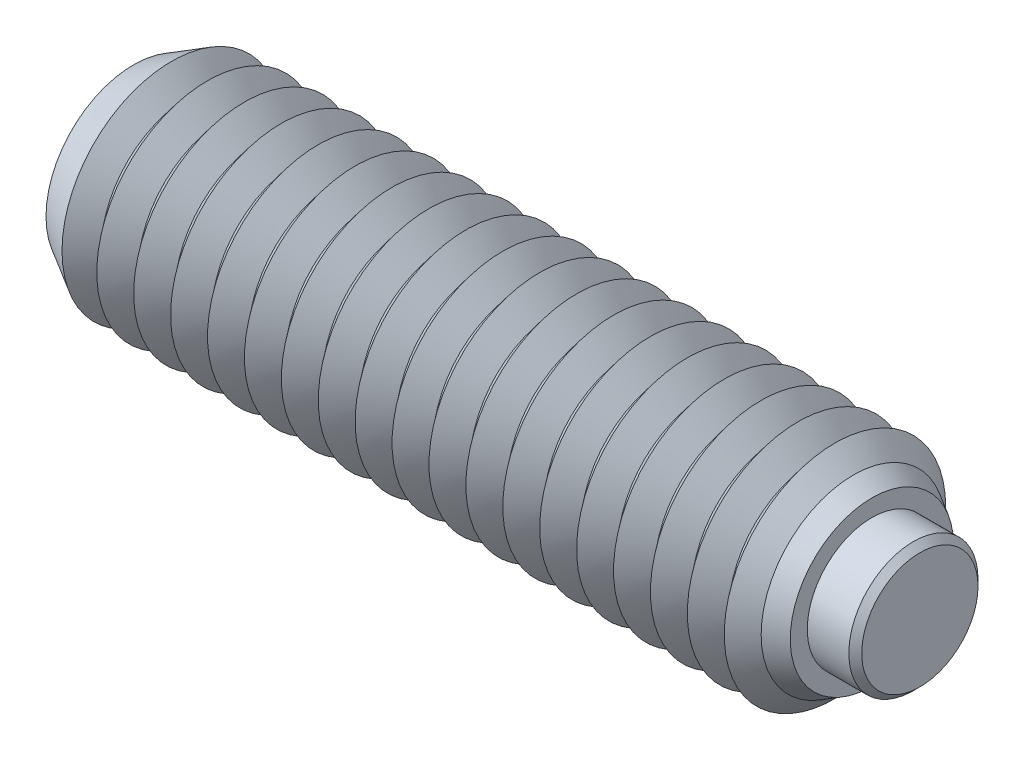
ISO-10303-21;
HEADER;
FILE_DESCRIPTION(('STEP AP214'),'2;1');
FILE_NAME('part.step','',(''),(''),'','','');
FILE_SCHEMA(('AUTOMOTIVE_DESIGN { 1 0 10303 214 1 1 1 1 }'));
ENDSEC;
DATA;
#1=APPLICATION_CONTEXT('core data for automotive mechanical design processes');
#2=APPLICATION_PROTOCOL_DEFINITION('international standard','automotive_design',2000,#1);
#3=PRODUCT_CONTEXT('',#1,'mechanical');
#4=PRODUCT('Part','Part','',(#3));
#5=PRODUCT_RELATED_PRODUCT_CATEGORY('part','',(#4));
#6=PRODUCT_DEFINITION_FORMATION('','',#4);
#7=PRODUCT_DEFINITION_CONTEXT('part definition',#1,'design');
#8=PRODUCT_DEFINITION('design','',#6,#7);
#9=PRODUCT_DEFINITION_SHAPE('','',#8);
#10=(LENGTH_UNIT() NAMED_UNIT(*) SI_UNIT(.MILLI.,.METRE.));
#11=(NAMED_UNIT(*) PLANE_ANGLE_UNIT() SI_UNIT($,.RADIAN.));
#12=(NAMED_UNIT(*) SI_UNIT($,.STERADIAN.) SOLID_ANGLE_UNIT());
#13=UNCERTAINTY_MEASURE_WITH_UNIT(LENGTH_MEASURE(1.E-05),#10,'distance_accuracy_value','');
#14=(GEOMETRIC_REPRESENTATION_CONTEXT(3) GLOBAL_UNCERTAINTY_ASSIGNED_CONTEXT((#13)) GLOBAL_UNIT_ASSIGNED_CONTEXT((#10,
#11,#12)) REPRESENTATION_CONTEXT('',''));
#15=CARTESIAN_POINT('',(0.,0.,0.));
#16=DIRECTION('',(0.,0.,1.));
#17=DIRECTION('',(1.,0.,0.));
#18=AXIS2_PLACEMENT_3D('',#15,#16,#17);
#19=CARTESIAN_POINT('',(1.8,0.,0.));
#20=DIRECTION('',(-1.,0.,0.));
#21=DIRECTION('',(0.,0.,1.));
#22=AXIS2_PLACEMENT_3D('',#19,#20,#21);
#23=CYLINDRICAL_SURFACE('',#22,1.75);
#24=CARTESIAN_POINT('',(1.625,0.,0.));
#25=DIRECTION('',(1.,0.,0.));
#26=DIRECTION('',(0.,0.,-1.));
#27=AXIS2_PLACEMENT_3D('',#24,#25,#26);
#28=CIRCLE('',#27,1.75);
#29=CARTESIAN_POINT('',(1.625,0.,-1.75));
#30=VERTEX_POINT('',#29);
#31=EDGE_CURVE('P0_E10',#30,#30,#28,.F.);
#32=ORIENTED_EDGE('',*,*,#31,.T.);
#33=EDGE_LOOP('',(#32));
#34=FACE_BOUND('',#33,.T.);
#35=CARTESIAN_POINT('',(-0.8,0.,0.));
#36=DIRECTION('',(1.,0.,0.));
#37=DIRECTION('',(0.,0.,-1.));
#38=AXIS2_PLACEMENT_3D('',#35,#36,#37);
#39=CIRCLE('',#38,1.75);
#40=CARTESIAN_POINT('',(-0.8,0.,-1.75));
#41=VERTEX_POINT('',#40);
#42=EDGE_CURVE('P0_E25',#41,#41,#39,.T.);
#43=ORIENTED_EDGE('',*,*,#42,.T.);
#44=EDGE_LOOP('',(#43));
#45=FACE_BOUND('',#44,.T.);
#46=ADVANCED_FACE('P0_F14',(#34,#45),#23,.T.);
#47=CARTESIAN_POINT('',(1.8,0.,0.));
#48=DIRECTION('',(1.,0.,0.));
#49=DIRECTION('',(0.,0.,-1.));
#50=AXIS2_PLACEMENT_3D('',#47,#48,#49);
#51=PLANE('',#50);
#52=CARTESIAN_POINT('',(1.8,0.,0.));
#53=DIRECTION('',(1.,0.,0.));
#54=DIRECTION('',(0.,0.,-1.));
#55=AXIS2_PLACEMENT_3D('',#52,#53,#54);
#56=CIRCLE('',#55,1.575);
#57=CARTESIAN_POINT('',(1.8,0.,-1.575));
#58=VERTEX_POINT('',#57);
#59=EDGE_CURVE('P0_E21',#58,#58,#56,.T.);
#60=ORIENTED_EDGE('',*,*,#59,.T.);
#61=EDGE_LOOP('',(#60));
#62=FACE_BOUND('',#61,.T.);
#63=ADVANCED_FACE('P0_F35',(#62),#51,.T.);
#64=CARTESIAN_POINT('',(-0.8,0.,0.));
#65=DIRECTION('',(1.,0.,0.));
#66=DIRECTION('',(0.,0.,-1.));
#67=AXIS2_PLACEMENT_3D('',#64,#65,#66);
#68=PLANE('',#67);
#69=ORIENTED_EDGE('',*,*,#42,.F.);
#70=EDGE_LOOP('',(#69));
#71=FACE_BOUND('',#70,.T.);
#72=ADVANCED_FACE('P0_F33',(#71),#68,.F.);
#73=CARTESIAN_POINT('',(1.8,0.,0.));
#74=DIRECTION('',(-1.,0.,0.));
#75=DIRECTION('',(0.,0.,1.));
#76=AXIS2_PLACEMENT_3D('',#73,#74,#75);
#77=CONICAL_SURFACE('',#76,1.575,0.785398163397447);
#78=ORIENTED_EDGE('',*,*,#31,.F.);
#79=EDGE_LOOP('',(#78));
#80=FACE_BOUND('',#79,.T.);
#81=ORIENTED_EDGE('',*,*,#59,.F.);
#82=EDGE_LOOP('',(#81));
#83=FACE_BOUND('',#82,.T.);
#84=ADVANCED_FACE('P0_F16',(#80,#83),#77,.T.);
#85=CLOSED_SHELL('',(#46,#63,#72,#84));
#86=MANIFOLD_SOLID_BREP('P0_B1',#85);
#87=CARTESIAN_POINT('',(-18.5,0.,0.));
#88=DIRECTION('',(-1.,0.,0.));
#89=DIRECTION('',(0.,0.,1.));
#90=AXIS2_PLACEMENT_3D('',#87,#88,#89);
#91=CONICAL_SURFACE('',#90,3.,0.895664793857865);
#92=CARTESIAN_POINT('',(-18.,0.,0.));
#93=DIRECTION('',(1.,0.,0.));
#94=DIRECTION('',(0.,0.,-1.));
#95=AXIS2_PLACEMENT_3D('',#92,#93,#94);
#96=CIRCLE('',#95,2.37550020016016);
#97=CARTESIAN_POINT('',(-18.,0.,-2.37550020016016));
#98=VERTEX_POINT('',#97);
#99=EDGE_CURVE('P1_E957',#98,#98,#96,.T.);
#100=ORIENTED_EDGE('',*,*,#99,.F.);
#101=EDGE_LOOP('',(#100));
#102=FACE_BOUND('',#101,.T.);
#103=CARTESIAN_POINT('',(-18.4741837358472,0.,0.));
#104=DIRECTION('',(1.,0.,0.));
#105=DIRECTION('',(0.,0.,-1.));
#106=AXIS2_PLACEMENT_3D('',#103,#104,#105);
#107=CIRCLE('',#106,2.96775549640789);
#108=CARTESIAN_POINT('',(-18.4741837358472,0.,-2.96775549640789));
#109=VERTEX_POINT('',#108);
#110=EDGE_CURVE('P1_E960',#109,#109,#107,.F.);
#111=ORIENTED_EDGE('',*,*,#110,.F.);
#112=EDGE_LOOP('',(#111));
#113=FACE_BOUND('',#112,.T.);
#114=ADVANCED_FACE('P1_F15',(#102,#113),#91,.T.);
#115=CARTESIAN_POINT('',(-1.,0.,0.));
#116=DIRECTION('',(1.,0.,0.));
#117=DIRECTION('',(0.,0.,-1.));
#118=AXIS2_PLACEMENT_3D('',#115,#116,#117);
#119=CONICAL_SURFACE('',#118,2.37550020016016,0.895664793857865);
#120=CARTESIAN_POINT('',(-0.500000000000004,0.,0.));
#121=DIRECTION('',(1.,0.,0.));
#122=DIRECTION('',(0.,0.,-1.));
#123=AXIS2_PLACEMENT_3D('',#120,#121,#122);
#124=CIRCLE('',#123,3.);
#125=CARTESIAN_POINT('',(-0.500000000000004,0.,-3.));
#126=VERTEX_POINT('',#125);
#127=EDGE_CURVE('P1_E851',#126,#126,#124,.T.);
#128=ORIENTED_EDGE('',*,*,#127,.F.);
#129=EDGE_LOOP('',(#128));
#130=FACE_BOUND('',#129,.T.);
#131=CARTESIAN_POINT('',(-1.,0.,0.));
#132=DIRECTION('',(1.,0.,0.));
#133=DIRECTION('',(0.,0.,-1.));
#134=AXIS2_PLACEMENT_3D('',#131,#132,#133);
#135=CIRCLE('',#134,2.37550020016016);
#136=CARTESIAN_POINT('',(-1.,0.,-2.37550020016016));
#137=VERTEX_POINT('',#136);
#138=EDGE_CURVE('P1_E852',#137,#137,#135,.T.);
#139=ORIENTED_EDGE('',*,*,#138,.T.);
#140=EDGE_LOOP('',(#139));
#141=FACE_BOUND('',#140,.T.);
#142=ADVANCED_FACE('P1_F222',(#130,#141),#119,.T.);
#143=CARTESIAN_POINT('',(-1.5,0.,0.));
#144=DIRECTION('',(-1.,0.,0.));
#145=DIRECTION('',(0.,0.,1.));
#146=AXIS2_PLACEMENT_3D('',#143,#144,#145);
#147=CONICAL_SURFACE('',#146,3.,0.895664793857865);
#148=ORIENTED_EDGE('',*,*,#138,.F.);
#149=EDGE_LOOP('',(#148));
#150=FACE_BOUND('',#149,.T.);
#151=CARTESIAN_POINT('',(-1.5,0.,0.));
#152=DIRECTION('',(1.,0.,0.));
#153=DIRECTION('',(0.,0.,-1.));
#154=AXIS2_PLACEMENT_3D('',#151,#152,#153);
#155=CIRCLE('',#154,3.);
#156=CARTESIAN_POINT('',(-1.5,0.,-3.));
#157=VERTEX_POINT('',#156);
#158=EDGE_CURVE('P1_E856',#157,#157,#155,.T.);
#159=ORIENTED_EDGE('',*,*,#158,.T.);
#160=EDGE_LOOP('',(#159));
#161=FACE_BOUND('',#160,.T.);
#162=ADVANCED_FACE('P1_F227',(#150,#161),#147,.T.);
#163=CARTESIAN_POINT('',(-0.8,0.,0.));
#164=DIRECTION('',(1.,0.,0.));
#165=DIRECTION('',(0.,1.,0.));
#166=AXIS2_PLACEMENT_3D('',#163,#164,#165);
#167=PLANE('',#166);
#168=CARTESIAN_POINT('',(-0.8,0.,0.));
#169=DIRECTION('',(1.,0.,0.));
#170=DIRECTION('',(0.,1.,0.));
#171=AXIS2_PLACEMENT_3D('',#168,#169,#170);
#172=CIRCLE('',#171,1.75);
#173=CARTESIAN_POINT('',(-0.8,1.75,0.));
#174=VERTEX_POINT('',#173);
#175=EDGE_CURVE('P1_E438',#174,#174,#172,.T.);
#176=ORIENTED_EDGE('',*,*,#175,.T.);
#177=EDGE_LOOP('',(#176));
#178=FACE_BOUND('',#177,.T.);
#179=ADVANCED_FACE('P1_F365',(#178),#167,.T.);
#180=CARTESIAN_POINT('',(-0.8,0.,0.));
#181=DIRECTION('',(1.,0.,0.));
#182=DIRECTION('',(0.,1.,0.));
#183=AXIS2_PLACEMENT_3D('',#180,#181,#182);
#184=CYLINDRICAL_SURFACE('',#183,1.75);
#185=ORIENTED_EDGE('',*,*,#175,.F.);
#186=EDGE_LOOP('',(#185));
#187=FACE_BOUND('',#186,.T.);
#188=CARTESIAN_POINT('',(0.5,0.,0.));
#189=DIRECTION('',(1.,0.,0.));
#190=DIRECTION('',(0.,1.,0.));
#191=AXIS2_PLACEMENT_3D('',#188,#189,#190);
#192=CIRCLE('',#191,1.75);
#193=CARTESIAN_POINT('',(0.5,1.75,0.));
#194=VERTEX_POINT('',#193);
#195=EDGE_CURVE('P1_E441',#194,#194,#192,.T.);
#196=ORIENTED_EDGE('',*,*,#195,.T.);
#197=EDGE_LOOP('',(#196));
#198=FACE_BOUND('',#197,.T.);
#199=ADVANCED_FACE('P1_F209',(#187,#198),#184,.F.);
#200=CARTESIAN_POINT('',(0.5,2.21132486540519,0.));
#201=DIRECTION('',(1.,0.,0.));
#202=DIRECTION('',(0.,1.,0.));
#203=AXIS2_PLACEMENT_3D('',#200,#201,#202);
#204=PLANE('',#203);
#205=ORIENTED_EDGE('',*,*,#195,.F.);
#206=EDGE_LOOP('',(#205));
#207=FACE_BOUND('',#206,.T.);
#208=CARTESIAN_POINT('',(0.5,0.,0.));
#209=DIRECTION('',(1.,0.,0.));
#210=DIRECTION('',(0.,1.,0.));
#211=AXIS2_PLACEMENT_3D('',#208,#209,#210);
#212=CIRCLE('',#211,2.21132486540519);
#213=CARTESIAN_POINT('',(0.5,2.21132486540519,0.));
#214=VERTEX_POINT('',#213);
#215=EDGE_CURVE('P1_E121',#214,#214,#212,.T.);
#216=ORIENTED_EDGE('',*,*,#215,.T.);
#217=EDGE_LOOP('',(#216));
#218=FACE_BOUND('',#217,.T.);
#219=ADVANCED_FACE('P1_F206',(#207,#218),#204,.T.);
#220=CARTESIAN_POINT('',(0.5,0.,0.));
#221=DIRECTION('',(-1.,0.,0.));
#222=DIRECTION('',(0.,-1.,0.));
#223=AXIS2_PLACEMENT_3D('',#220,#221,#222);
#224=CONICAL_SURFACE('',#223,2.21132486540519,0.523598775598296);
#225=CARTESIAN_POINT('',(0.,0.,0.));
#226=DIRECTION('',(1.,0.,0.));
#227=DIRECTION('',(0.,0.,-1.));
#228=AXIS2_PLACEMENT_3D('',#225,#226,#227);
#229=CIRCLE('',#228,2.5);
#230=CARTESIAN_POINT('',(0.,0.,-2.5));
#231=VERTEX_POINT('',#230);
#232=EDGE_CURVE('P1_E429',#231,#231,#229,.T.);
#233=ORIENTED_EDGE('',*,*,#232,.T.);
#234=EDGE_LOOP('',(#233));
#235=FACE_BOUND('',#234,.T.);
#236=ORIENTED_EDGE('',*,*,#215,.F.);
#237=EDGE_LOOP('',(#236));
#238=FACE_BOUND('',#237,.T.);
#239=ADVANCED_FACE('P1_F203',(#235,#238),#224,.T.);
#240=CARTESIAN_POINT('',(0.,0.,0.));
#241=DIRECTION('',(-1.,0.,0.));
#242=DIRECTION('',(0.,0.,1.));
#243=AXIS2_PLACEMENT_3D('',#240,#241,#242);
#244=CONICAL_SURFACE('',#243,2.5,0.785398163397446);
#245=ORIENTED_EDGE('',*,*,#127,.T.);
#246=EDGE_LOOP('',(#245));
#247=FACE_BOUND('',#246,.T.);
#248=ORIENTED_EDGE('',*,*,#232,.F.);
#249=EDGE_LOOP('',(#248));
#250=FACE_BOUND('',#249,.T.);
#251=ADVANCED_FACE('P1_F17',(#247,#250),#244,.T.);
#252=CARTESIAN_POINT('',(-2.,0.,0.));
#253=DIRECTION('',(1.,0.,0.));
#254=DIRECTION('',(0.,0.,-1.));
#255=AXIS2_PLACEMENT_3D('',#252,#253,#254);
#256=CONICAL_SURFACE('',#255,2.37550020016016,0.895664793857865);
#257=ORIENTED_EDGE('',*,*,#158,.F.);
#258=EDGE_LOOP('',(#257));
#259=FACE_BOUND('',#258,.T.);
#260=CARTESIAN_POINT('',(-2.,0.,0.));
#261=DIRECTION('',(1.,0.,0.));
#262=DIRECTION('',(0.,0.,-1.));
#263=AXIS2_PLACEMENT_3D('',#260,#261,#262);
#264=CIRCLE('',#263,2.37550020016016);
#265=CARTESIAN_POINT('',(-2.,0.,-2.37550020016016));
#266=VERTEX_POINT('',#265);
#267=EDGE_CURVE('P1_E861',#266,#266,#264,.T.);
#268=ORIENTED_EDGE('',*,*,#267,.T.);
#269=EDGE_LOOP('',(#268));
#270=FACE_BOUND('',#269,.T.);
#271=ADVANCED_FACE('P1_F359',(#259,#270),#256,.T.);
#272=CARTESIAN_POINT('',(-2.5,0.,0.));
#273=DIRECTION('',(-1.,0.,0.));
#274=DIRECTION('',(0.,0.,1.));
#275=AXIS2_PLACEMENT_3D('',#272,#273,#274);
#276=CONICAL_SURFACE('',#275,3.,0.895664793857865);
#277=ORIENTED_EDGE('',*,*,#267,.F.);
#278=EDGE_LOOP('',(#277));
#279=FACE_BOUND('',#278,.T.);
#280=CARTESIAN_POINT('',(-2.5,0.,0.));
#281=DIRECTION('',(1.,0.,0.));
#282=DIRECTION('',(0.,0.,-1.));
#283=AXIS2_PLACEMENT_3D('',#280,#281,#282);
#284=CIRCLE('',#283,3.);
#285=CARTESIAN_POINT('',(-2.5,0.,-3.));
#286=VERTEX_POINT('',#285);
#287=EDGE_CURVE('P1_E864',#286,#286,#284,.T.);
#288=ORIENTED_EDGE('',*,*,#287,.T.);
#289=EDGE_LOOP('',(#288));
#290=FACE_BOUND('',#289,.T.);
#291=ADVANCED_FACE('P1_F355',(#279,#290),#276,.T.);
#292=CARTESIAN_POINT('',(-3.,0.,0.));
#293=DIRECTION('',(1.,0.,0.));
#294=DIRECTION('',(0.,0.,-1.));
#295=AXIS2_PLACEMENT_3D('',#292,#293,#294);
#296=CONICAL_SURFACE('',#295,2.37550020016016,0.895664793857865);
#297=ORIENTED_EDGE('',*,*,#287,.F.);
#298=EDGE_LOOP('',(#297));
#299=FACE_BOUND('',#298,.T.);
#300=CARTESIAN_POINT('',(-3.,0.,0.));
#301=DIRECTION('',(1.,0.,0.));
#302=DIRECTION('',(0.,0.,-1.));
#303=AXIS2_PLACEMENT_3D('',#300,#301,#302);
#304=CIRCLE('',#303,2.37550020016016);
#305=CARTESIAN_POINT('',(-3.,0.,-2.37550020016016));
#306=VERTEX_POINT('',#305);
#307=EDGE_CURVE('P1_E867',#306,#306,#304,.T.);
#308=ORIENTED_EDGE('',*,*,#307,.T.);
#309=EDGE_LOOP('',(#308));
#310=FACE_BOUND('',#309,.T.);
#311=ADVANCED_FACE('P1_F351',(#299,#310),#296,.T.);
#312=CARTESIAN_POINT('',(-3.5,0.,0.));
#313=DIRECTION('',(-1.,0.,0.));
#314=DIRECTION('',(0.,0.,1.));
#315=AXIS2_PLACEMENT_3D('',#312,#313,#314);
#316=CONICAL_SURFACE('',#315,3.,0.895664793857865);
#317=ORIENTED_EDGE('',*,*,#307,.F.);
#318=EDGE_LOOP('',(#317));
#319=FACE_BOUND('',#318,.T.);
#320=CARTESIAN_POINT('',(-3.5,0.,0.));
#321=DIRECTION('',(1.,0.,0.));
#322=DIRECTION('',(0.,0.,-1.));
#323=AXIS2_PLACEMENT_3D('',#320,#321,#322);
#324=CIRCLE('',#323,3.);
#325=CARTESIAN_POINT('',(-3.5,0.,-3.));
#326=VERTEX_POINT('',#325);
#327=EDGE_CURVE('P1_E870',#326,#326,#324,.T.);
#328=ORIENTED_EDGE('',*,*,#327,.T.);
#329=EDGE_LOOP('',(#328));
#330=FACE_BOUND('',#329,.T.);
#331=ADVANCED_FACE('P1_F347',(#319,#330),#316,.T.);
#332=CARTESIAN_POINT('',(-4.,0.,0.));
#333=DIRECTION('',(1.,0.,0.));
#334=DIRECTION('',(0.,0.,-1.));
#335=AXIS2_PLACEMENT_3D('',#332,#333,#334);
#336=CONICAL_SURFACE('',#335,2.37550020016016,0.895664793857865);
#337=ORIENTED_EDGE('',*,*,#327,.F.);
#338=EDGE_LOOP('',(#337));
#339=FACE_BOUND('',#338,.T.);
#340=CARTESIAN_POINT('',(-4.,0.,0.));
#341=DIRECTION('',(1.,0.,0.));
#342=DIRECTION('',(0.,0.,-1.));
#343=AXIS2_PLACEMENT_3D('',#340,#341,#342);
#344=CIRCLE('',#343,2.37550020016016);
#345=CARTESIAN_POINT('',(-4.,0.,-2.37550020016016));
#346=VERTEX_POINT('',#345);
#347=EDGE_CURVE('P1_E873',#346,#346,#344,.T.);
#348=ORIENTED_EDGE('',*,*,#347,.T.);
#349=EDGE_LOOP('',(#348));
#350=FACE_BOUND('',#349,.T.);
#351=ADVANCED_FACE('P1_F343',(#339,#350),#336,.T.);
#352=CARTESIAN_POINT('',(-4.5,0.,0.));
#353=DIRECTION('',(-1.,0.,0.));
#354=DIRECTION('',(0.,0.,1.));
#355=AXIS2_PLACEMENT_3D('',#352,#353,#354);
#356=CONICAL_SURFACE('',#355,3.,0.895664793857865);
#357=ORIENTED_EDGE('',*,*,#347,.F.);
#358=EDGE_LOOP('',(#357));
#359=FACE_BOUND('',#358,.T.);
#360=CARTESIAN_POINT('',(-4.5,0.,0.));
#361=DIRECTION('',(1.,0.,0.));
#362=DIRECTION('',(0.,0.,-1.));
#363=AXIS2_PLACEMENT_3D('',#360,#361,#362);
#364=CIRCLE('',#363,3.);
#365=CARTESIAN_POINT('',(-4.5,0.,-3.));
#366=VERTEX_POINT('',#365);
#367=EDGE_CURVE('P1_E876',#366,#366,#364,.T.);
#368=ORIENTED_EDGE('',*,*,#367,.T.);
#369=EDGE_LOOP('',(#368));
#370=FACE_BOUND('',#369,.T.);
#371=ADVANCED_FACE('P1_F339',(#359,#370),#356,.T.);
#372=CARTESIAN_POINT('',(-5.,0.,0.));
#373=DIRECTION('',(1.,0.,0.));
#374=DIRECTION('',(0.,0.,-1.));
#375=AXIS2_PLACEMENT_3D('',#372,#373,#374);
#376=CONICAL_SURFACE('',#375,2.37550020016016,0.895664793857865);
#377=ORIENTED_EDGE('',*,*,#367,.F.);
#378=EDGE_LOOP('',(#377));
#379=FACE_BOUND('',#378,.T.);
#380=CARTESIAN_POINT('',(-5.,0.,0.));
#381=DIRECTION('',(1.,0.,0.));
#382=DIRECTION('',(0.,0.,-1.));
#383=AXIS2_PLACEMENT_3D('',#380,#381,#382);
#384=CIRCLE('',#383,2.37550020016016);
#385=CARTESIAN_POINT('',(-5.,0.,-2.37550020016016));
#386=VERTEX_POINT('',#385);
#387=EDGE_CURVE('P1_E879',#386,#386,#384,.T.);
#388=ORIENTED_EDGE('',*,*,#387,.T.);
#389=EDGE_LOOP('',(#388));
#390=FACE_BOUND('',#389,.T.);
#391=ADVANCED_FACE('P1_F335',(#379,#390),#376,.T.);
#392=CARTESIAN_POINT('',(-5.5,0.,0.));
#393=DIRECTION('',(-1.,0.,0.));
#394=DIRECTION('',(0.,0.,1.));
#395=AXIS2_PLACEMENT_3D('',#392,#393,#394);
#396=CONICAL_SURFACE('',#395,3.,0.895664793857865);
#397=ORIENTED_EDGE('',*,*,#387,.F.);
#398=EDGE_LOOP('',(#397));
#399=FACE_BOUND('',#398,.T.);
#400=CARTESIAN_POINT('',(-5.5,0.,0.));
#401=DIRECTION('',(1.,0.,0.));
#402=DIRECTION('',(0.,0.,-1.));
#403=AXIS2_PLACEMENT_3D('',#400,#401,#402);
#404=CIRCLE('',#403,3.);
#405=CARTESIAN_POINT('',(-5.5,0.,-3.));
#406=VERTEX_POINT('',#405);
#407=EDGE_CURVE('P1_E882',#406,#406,#404,.T.);
#408=ORIENTED_EDGE('',*,*,#407,.T.);
#409=EDGE_LOOP('',(#408));
#410=FACE_BOUND('',#409,.T.);
#411=ADVANCED_FACE('P1_F331',(#399,#410),#396,.T.);
#412=CARTESIAN_POINT('',(-6.,0.,0.));
#413=DIRECTION('',(1.,0.,0.));
#414=DIRECTION('',(0.,0.,-1.));
#415=AXIS2_PLACEMENT_3D('',#412,#413,#414);
#416=CONICAL_SURFACE('',#415,2.37550020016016,0.895664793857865);
#417=ORIENTED_EDGE('',*,*,#407,.F.);
#418=EDGE_LOOP('',(#417));
#419=FACE_BOUND('',#418,.T.);
#420=CARTESIAN_POINT('',(-6.,0.,0.));
#421=DIRECTION('',(1.,0.,0.));
#422=DIRECTION('',(0.,0.,-1.));
#423=AXIS2_PLACEMENT_3D('',#420,#421,#422);
#424=CIRCLE('',#423,2.37550020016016);
#425=CARTESIAN_POINT('',(-6.,0.,-2.37550020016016));
#426=VERTEX_POINT('',#425);
#427=EDGE_CURVE('P1_E885',#426,#426,#424,.T.);
#428=ORIENTED_EDGE('',*,*,#427,.T.);
#429=EDGE_LOOP('',(#428));
#430=FACE_BOUND('',#429,.T.);
#431=ADVANCED_FACE('P1_F327',(#419,#430),#416,.T.);
#432=CARTESIAN_POINT('',(-6.5,0.,0.));
#433=DIRECTION('',(-1.,0.,0.));
#434=DIRECTION('',(0.,0.,1.));
#435=AXIS2_PLACEMENT_3D('',#432,#433,#434);
#436=CONICAL_SURFACE('',#435,3.,0.895664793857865);
#437=ORIENTED_EDGE('',*,*,#427,.F.);
#438=EDGE_LOOP('',(#437));
#439=FACE_BOUND('',#438,.T.);
#440=CARTESIAN_POINT('',(-6.5,0.,0.));
#441=DIRECTION('',(1.,0.,0.));
#442=DIRECTION('',(0.,0.,-1.));
#443=AXIS2_PLACEMENT_3D('',#440,#441,#442);
#444=CIRCLE('',#443,3.);
#445=CARTESIAN_POINT('',(-6.5,0.,-3.));
#446=VERTEX_POINT('',#445);
#447=EDGE_CURVE('P1_E888',#446,#446,#444,.T.);
#448=ORIENTED_EDGE('',*,*,#447,.T.);
#449=EDGE_LOOP('',(#448));
#450=FACE_BOUND('',#449,.T.);
#451=ADVANCED_FACE('P1_F323',(#439,#450),#436,.T.);
#452=CARTESIAN_POINT('',(-7.,0.,0.));
#453=DIRECTION('',(1.,0.,0.));
#454=DIRECTION('',(0.,0.,-1.));
#455=AXIS2_PLACEMENT_3D('',#452,#453,#454);
#456=CONICAL_SURFACE('',#455,2.37550020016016,0.895664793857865);
#457=ORIENTED_EDGE('',*,*,#447,.F.);
#458=EDGE_LOOP('',(#457));
#459=FACE_BOUND('',#458,.T.);
#460=CARTESIAN_POINT('',(-7.,0.,0.));
#461=DIRECTION('',(1.,0.,0.));
#462=DIRECTION('',(0.,0.,-1.));
#463=AXIS2_PLACEMENT_3D('',#460,#461,#462);
#464=CIRCLE('',#463,2.37550020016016);
#465=CARTESIAN_POINT('',(-7.,0.,-2.37550020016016));
#466=VERTEX_POINT('',#465);
#467=EDGE_CURVE('P1_E891',#466,#466,#464,.T.);
#468=ORIENTED_EDGE('',*,*,#467,.T.);
#469=EDGE_LOOP('',(#468));
#470=FACE_BOUND('',#469,.T.);
#471=ADVANCED_FACE('P1_F319',(#459,#470),#456,.T.);
#472=CARTESIAN_POINT('',(-7.5,0.,0.));
#473=DIRECTION('',(-1.,0.,0.));
#474=DIRECTION('',(0.,0.,1.));
#475=AXIS2_PLACEMENT_3D('',#472,#473,#474);
#476=CONICAL_SURFACE('',#475,3.,0.895664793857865);
#477=ORIENTED_EDGE('',*,*,#467,.F.);
#478=EDGE_LOOP('',(#477));
#479=FACE_BOUND('',#478,.T.);
#480=CARTESIAN_POINT('',(-7.5,0.,0.));
#481=DIRECTION('',(1.,0.,0.));
#482=DIRECTION('',(0.,0.,-1.));
#483=AXIS2_PLACEMENT_3D('',#480,#481,#482);
#484=CIRCLE('',#483,3.);
#485=CARTESIAN_POINT('',(-7.5,0.,-3.));
#486=VERTEX_POINT('',#485);
#487=EDGE_CURVE('P1_E894',#486,#486,#484,.T.);
#488=ORIENTED_EDGE('',*,*,#487,.T.);
#489=EDGE_LOOP('',(#488));
#490=FACE_BOUND('',#489,.T.);
#491=ADVANCED_FACE('P1_F315',(#479,#490),#476,.T.);
#492=CARTESIAN_POINT('',(-8.,0.,0.));
#493=DIRECTION('',(1.,0.,0.));
#494=DIRECTION('',(0.,0.,-1.));
#495=AXIS2_PLACEMENT_3D('',#492,#493,#494);
#496=CONICAL_SURFACE('',#495,2.37550020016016,0.895664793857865);
#497=ORIENTED_EDGE('',*,*,#487,.F.);
#498=EDGE_LOOP('',(#497));
#499=FACE_BOUND('',#498,.T.);
#500=CARTESIAN_POINT('',(-8.,0.,0.));
#501=DIRECTION('',(1.,0.,0.));
#502=DIRECTION('',(0.,0.,-1.));
#503=AXIS2_PLACEMENT_3D('',#500,#501,#502);
#504=CIRCLE('',#503,2.37550020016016);
#505=CARTESIAN_POINT('',(-8.,0.,-2.37550020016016));
#506=VERTEX_POINT('',#505);
#507=EDGE_CURVE('P1_E897',#506,#506,#504,.T.);
#508=ORIENTED_EDGE('',*,*,#507,.T.);
#509=EDGE_LOOP('',(#508));
#510=FACE_BOUND('',#509,.T.);
#511=ADVANCED_FACE('P1_F311',(#499,#510),#496,.T.);
#512=CARTESIAN_POINT('',(-8.5,0.,0.));
#513=DIRECTION('',(-1.,0.,0.));
#514=DIRECTION('',(0.,0.,1.));
#515=AXIS2_PLACEMENT_3D('',#512,#513,#514);
#516=CONICAL_SURFACE('',#515,3.,0.895664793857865);
#517=ORIENTED_EDGE('',*,*,#507,.F.);
#518=EDGE_LOOP('',(#517));
#519=FACE_BOUND('',#518,.T.);
#520=CARTESIAN_POINT('',(-8.5,0.,0.));
#521=DIRECTION('',(1.,0.,0.));
#522=DIRECTION('',(0.,0.,-1.));
#523=AXIS2_PLACEMENT_3D('',#520,#521,#522);
#524=CIRCLE('',#523,3.);
#525=CARTESIAN_POINT('',(-8.5,0.,-3.));
#526=VERTEX_POINT('',#525);
#527=EDGE_CURVE('P1_E900',#526,#526,#524,.T.);
#528=ORIENTED_EDGE('',*,*,#527,.T.);
#529=EDGE_LOOP('',(#528));
#530=FACE_BOUND('',#529,.T.);
#531=ADVANCED_FACE('P1_F307',(#519,#530),#516,.T.);
#532=CARTESIAN_POINT('',(-9.00000000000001,0.,0.));
#533=DIRECTION('',(1.,0.,0.));
#534=DIRECTION('',(0.,0.,-1.));
#535=AXIS2_PLACEMENT_3D('',#532,#533,#534);
#536=CONICAL_SURFACE('',#535,2.37550020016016,0.895664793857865);
#537=ORIENTED_EDGE('',*,*,#527,.F.);
#538=EDGE_LOOP('',(#537));
#539=FACE_BOUND('',#538,.T.);
#540=CARTESIAN_POINT('',(-9.00000000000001,0.,0.));
#541=DIRECTION('',(1.,0.,0.));
#542=DIRECTION('',(0.,0.,-1.));
#543=AXIS2_PLACEMENT_3D('',#540,#541,#542);
#544=CIRCLE('',#543,2.37550020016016);
#545=CARTESIAN_POINT('',(-9.00000000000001,0.,-2.37550020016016));
#546=VERTEX_POINT('',#545);
#547=EDGE_CURVE('P1_E903',#546,#546,#544,.T.);
#548=ORIENTED_EDGE('',*,*,#547,.T.);
#549=EDGE_LOOP('',(#548));
#550=FACE_BOUND('',#549,.T.);
#551=ADVANCED_FACE('P1_F303',(#539,#550),#536,.T.);
#552=CARTESIAN_POINT('',(-9.50000000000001,0.,0.));
#553=DIRECTION('',(-1.,0.,0.));
#554=DIRECTION('',(0.,0.,1.));
#555=AXIS2_PLACEMENT_3D('',#552,#553,#554);
#556=CONICAL_SURFACE('',#555,3.,0.895664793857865);
#557=ORIENTED_EDGE('',*,*,#547,.F.);
#558=EDGE_LOOP('',(#557));
#559=FACE_BOUND('',#558,.T.);
#560=CARTESIAN_POINT('',(-9.50000000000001,0.,0.));
#561=DIRECTION('',(1.,0.,0.));
#562=DIRECTION('',(0.,0.,-1.));
#563=AXIS2_PLACEMENT_3D('',#560,#561,#562);
#564=CIRCLE('',#563,3.);
#565=CARTESIAN_POINT('',(-9.50000000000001,0.,-3.));
#566=VERTEX_POINT('',#565);
#567=EDGE_CURVE('P1_E906',#566,#566,#564,.T.);
#568=ORIENTED_EDGE('',*,*,#567,.T.);
#569=EDGE_LOOP('',(#568));
#570=FACE_BOUND('',#569,.T.);
#571=ADVANCED_FACE('P1_F299',(#559,#570),#556,.T.);
#572=CARTESIAN_POINT('',(-10.,0.,0.));
#573=DIRECTION('',(1.,0.,0.));
#574=DIRECTION('',(0.,0.,-1.));
#575=AXIS2_PLACEMENT_3D('',#572,#573,#574);
#576=CONICAL_SURFACE('',#575,2.37550020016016,0.895664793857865);
#577=ORIENTED_EDGE('',*,*,#567,.F.);
#578=EDGE_LOOP('',(#577));
#579=FACE_BOUND('',#578,.T.);
#580=CARTESIAN_POINT('',(-10.,0.,0.));
#581=DIRECTION('',(1.,0.,0.));
#582=DIRECTION('',(0.,0.,-1.));
#583=AXIS2_PLACEMENT_3D('',#580,#581,#582);
#584=CIRCLE('',#583,2.37550020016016);
#585=CARTESIAN_POINT('',(-10.,0.,-2.37550020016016));
#586=VERTEX_POINT('',#585);
#587=EDGE_CURVE('P1_E909',#586,#586,#584,.T.);
#588=ORIENTED_EDGE('',*,*,#587,.T.);
#589=EDGE_LOOP('',(#588));
#590=FACE_BOUND('',#589,.T.);
#591=ADVANCED_FACE('P1_F295',(#579,#590),#576,.T.);
#592=CARTESIAN_POINT('',(-10.5,0.,0.));
#593=DIRECTION('',(-1.,0.,0.));
#594=DIRECTION('',(0.,0.,1.));
#595=AXIS2_PLACEMENT_3D('',#592,#593,#594);
#596=CONICAL_SURFACE('',#595,3.,0.895664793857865);
#597=ORIENTED_EDGE('',*,*,#587,.F.);
#598=EDGE_LOOP('',(#597));
#599=FACE_BOUND('',#598,.T.);
#600=CARTESIAN_POINT('',(-10.5,0.,0.));
#601=DIRECTION('',(1.,0.,0.));
#602=DIRECTION('',(0.,0.,-1.));
#603=AXIS2_PLACEMENT_3D('',#600,#601,#602);
#604=CIRCLE('',#603,3.);
#605=CARTESIAN_POINT('',(-10.5,0.,-3.));
#606=VERTEX_POINT('',#605);
#607=EDGE_CURVE('P1_E912',#606,#606,#604,.T.);
#608=ORIENTED_EDGE('',*,*,#607,.T.);
#609=EDGE_LOOP('',(#608));
#610=FACE_BOUND('',#609,.T.);
#611=ADVANCED_FACE('P1_F291',(#599,#610),#596,.T.);
#612=CARTESIAN_POINT('',(-11.,0.,0.));
#613=DIRECTION('',(1.,0.,0.));
#614=DIRECTION('',(0.,0.,-1.));
#615=AXIS2_PLACEMENT_3D('',#612,#613,#614);
#616=CONICAL_SURFACE('',#615,2.37550020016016,0.895664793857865);
#617=ORIENTED_EDGE('',*,*,#607,.F.);
#618=EDGE_LOOP('',(#617));
#619=FACE_BOUND('',#618,.T.);
#620=CARTESIAN_POINT('',(-11.,0.,0.));
#621=DIRECTION('',(1.,0.,0.));
#622=DIRECTION('',(0.,0.,-1.));
#623=AXIS2_PLACEMENT_3D('',#620,#621,#622);
#624=CIRCLE('',#623,2.37550020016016);
#625=CARTESIAN_POINT('',(-11.,0.,-2.37550020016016));
#626=VERTEX_POINT('',#625);
#627=EDGE_CURVE('P1_E915',#626,#626,#624,.T.);
#628=ORIENTED_EDGE('',*,*,#627,.T.);
#629=EDGE_LOOP('',(#628));
#630=FACE_BOUND('',#629,.T.);
#631=ADVANCED_FACE('P1_F287',(#619,#630),#616,.T.);
#632=CARTESIAN_POINT('',(-11.5,0.,0.));
#633=DIRECTION('',(-1.,0.,0.));
#634=DIRECTION('',(0.,0.,1.));
#635=AXIS2_PLACEMENT_3D('',#632,#633,#634);
#636=CONICAL_SURFACE('',#635,3.,0.895664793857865);
#637=ORIENTED_EDGE('',*,*,#627,.F.);
#638=EDGE_LOOP('',(#637));
#639=FACE_BOUND('',#638,.T.);
#640=CARTESIAN_POINT('',(-11.5,0.,0.));
#641=DIRECTION('',(1.,0.,0.));
#642=DIRECTION('',(0.,0.,-1.));
#643=AXIS2_PLACEMENT_3D('',#640,#641,#642);
#644=CIRCLE('',#643,3.);
#645=CARTESIAN_POINT('',(-11.5,0.,-3.));
#646=VERTEX_POINT('',#645);
#647=EDGE_CURVE('P1_E918',#646,#646,#644,.T.);
#648=ORIENTED_EDGE('',*,*,#647,.T.);
#649=EDGE_LOOP('',(#648));
#650=FACE_BOUND('',#649,.T.);
#651=ADVANCED_FACE('P1_F283',(#639,#650),#636,.T.);
#652=CARTESIAN_POINT('',(-12.,0.,0.));
#653=DIRECTION('',(1.,0.,0.));
#654=DIRECTION('',(0.,0.,-1.));
#655=AXIS2_PLACEMENT_3D('',#652,#653,#654);
#656=CONICAL_SURFACE('',#655,2.37550020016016,0.895664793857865);
#657=ORIENTED_EDGE('',*,*,#647,.F.);
#658=EDGE_LOOP('',(#657));
#659=FACE_BOUND('',#658,.T.);
#660=CARTESIAN_POINT('',(-12.,0.,0.));
#661=DIRECTION('',(1.,0.,0.));
#662=DIRECTION('',(0.,0.,-1.));
#663=AXIS2_PLACEMENT_3D('',#660,#661,#662);
#664=CIRCLE('',#663,2.37550020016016);
#665=CARTESIAN_POINT('',(-12.,0.,-2.37550020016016));
#666=VERTEX_POINT('',#665);
#667=EDGE_CURVE('P1_E921',#666,#666,#664,.T.);
#668=ORIENTED_EDGE('',*,*,#667,.T.);
#669=EDGE_LOOP('',(#668));
#670=FACE_BOUND('',#669,.T.);
#671=ADVANCED_FACE('P1_F279',(#659,#670),#656,.T.);
#672=CARTESIAN_POINT('',(-12.5,0.,0.));
#673=DIRECTION('',(-1.,0.,0.));
#674=DIRECTION('',(0.,0.,1.));
#675=AXIS2_PLACEMENT_3D('',#672,#673,#674);
#676=CONICAL_SURFACE('',#675,3.,0.895664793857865);
#677=ORIENTED_EDGE('',*,*,#667,.F.);
#678=EDGE_LOOP('',(#677));
#679=FACE_BOUND('',#678,.T.);
#680=CARTESIAN_POINT('',(-12.5,0.,0.));
#681=DIRECTION('',(1.,0.,0.));
#682=DIRECTION('',(0.,0.,-1.));
#683=AXIS2_PLACEMENT_3D('',#680,#681,#682);
#684=CIRCLE('',#683,3.);
#685=CARTESIAN_POINT('',(-12.5,0.,-3.));
#686=VERTEX_POINT('',#685);
#687=EDGE_CURVE('P1_E924',#686,#686,#684,.T.);
#688=ORIENTED_EDGE('',*,*,#687,.T.);
#689=EDGE_LOOP('',(#688));
#690=FACE_BOUND('',#689,.T.);
#691=ADVANCED_FACE('P1_F275',(#679,#690),#676,.T.);
#692=CARTESIAN_POINT('',(-13.,0.,0.));
#693=DIRECTION('',(1.,0.,0.));
#694=DIRECTION('',(0.,0.,-1.));
#695=AXIS2_PLACEMENT_3D('',#692,#693,#694);
#696=CONICAL_SURFACE('',#695,2.37550020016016,0.895664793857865);
#697=ORIENTED_EDGE('',*,*,#687,.F.);
#698=EDGE_LOOP('',(#697));
#699=FACE_BOUND('',#698,.T.);
#700=CARTESIAN_POINT('',(-13.,0.,0.));
#701=DIRECTION('',(1.,0.,0.));
#702=DIRECTION('',(0.,0.,-1.));
#703=AXIS2_PLACEMENT_3D('',#700,#701,#702);
#704=CIRCLE('',#703,2.37550020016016);
#705=CARTESIAN_POINT('',(-13.,0.,-2.37550020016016));
#706=VERTEX_POINT('',#705);
#707=EDGE_CURVE('P1_E927',#706,#706,#704,.T.);
#708=ORIENTED_EDGE('',*,*,#707,.T.);
#709=EDGE_LOOP('',(#708));
#710=FACE_BOUND('',#709,.T.);
#711=ADVANCED_FACE('P1_F271',(#699,#710),#696,.T.);
#712=CARTESIAN_POINT('',(-13.5,0.,0.));
#713=DIRECTION('',(-1.,0.,0.));
#714=DIRECTION('',(0.,0.,1.));
#715=AXIS2_PLACEMENT_3D('',#712,#713,#714);
#716=CONICAL_SURFACE('',#715,3.,0.895664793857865);
#717=ORIENTED_EDGE('',*,*,#707,.F.);
#718=EDGE_LOOP('',(#717));
#719=FACE_BOUND('',#718,.T.);
#720=CARTESIAN_POINT('',(-13.5,0.,0.));
#721=DIRECTION('',(1.,0.,0.));
#722=DIRECTION('',(0.,0.,-1.));
#723=AXIS2_PLACEMENT_3D('',#720,#721,#722);
#724=CIRCLE('',#723,3.);
#725=CARTESIAN_POINT('',(-13.5,0.,-3.));
#726=VERTEX_POINT('',#725);
#727=EDGE_CURVE('P1_E930',#726,#726,#724,.T.);
#728=ORIENTED_EDGE('',*,*,#727,.T.);
#729=EDGE_LOOP('',(#728));
#730=FACE_BOUND('',#729,.T.);
#731=ADVANCED_FACE('P1_F267',(#719,#730),#716,.T.);
#732=CARTESIAN_POINT('',(-14.,0.,0.));
#733=DIRECTION('',(1.,0.,0.));
#734=DIRECTION('',(0.,0.,-1.));
#735=AXIS2_PLACEMENT_3D('',#732,#733,#734);
#736=CONICAL_SURFACE('',#735,2.37550020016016,0.895664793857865);
#737=ORIENTED_EDGE('',*,*,#727,.F.);
#738=EDGE_LOOP('',(#737));
#739=FACE_BOUND('',#738,.T.);
#740=CARTESIAN_POINT('',(-14.,0.,0.));
#741=DIRECTION('',(1.,0.,0.));
#742=DIRECTION('',(0.,0.,-1.));
#743=AXIS2_PLACEMENT_3D('',#740,#741,#742);
#744=CIRCLE('',#743,2.37550020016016);
#745=CARTESIAN_POINT('',(-14.,0.,-2.37550020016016));
#746=VERTEX_POINT('',#745);
#747=EDGE_CURVE('P1_E933',#746,#746,#744,.T.);
#748=ORIENTED_EDGE('',*,*,#747,.T.);
#749=EDGE_LOOP('',(#748));
#750=FACE_BOUND('',#749,.T.);
#751=ADVANCED_FACE('P1_F263',(#739,#750),#736,.T.);
#752=CARTESIAN_POINT('',(-14.5,0.,0.));
#753=DIRECTION('',(-1.,0.,0.));
#754=DIRECTION('',(0.,0.,1.));
#755=AXIS2_PLACEMENT_3D('',#752,#753,#754);
#756=CONICAL_SURFACE('',#755,3.,0.895664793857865);
#757=ORIENTED_EDGE('',*,*,#747,.F.);
#758=EDGE_LOOP('',(#757));
#759=FACE_BOUND('',#758,.T.);
#760=CARTESIAN_POINT('',(-14.5,0.,0.));
#761=DIRECTION('',(1.,0.,0.));
#762=DIRECTION('',(0.,0.,-1.));
#763=AXIS2_PLACEMENT_3D('',#760,#761,#762);
#764=CIRCLE('',#763,3.);
#765=CARTESIAN_POINT('',(-14.5,0.,-3.));
#766=VERTEX_POINT('',#765);
#767=EDGE_CURVE('P1_E936',#766,#766,#764,.T.);
#768=ORIENTED_EDGE('',*,*,#767,.T.);
#769=EDGE_LOOP('',(#768));
#770=FACE_BOUND('',#769,.T.);
#771=ADVANCED_FACE('P1_F259',(#759,#770),#756,.T.);
#772=CARTESIAN_POINT('',(-15.,0.,0.));
#773=DIRECTION('',(1.,0.,0.));
#774=DIRECTION('',(0.,0.,-1.));
#775=AXIS2_PLACEMENT_3D('',#772,#773,#774);
#776=CONICAL_SURFACE('',#775,2.37550020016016,0.895664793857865);
#777=ORIENTED_EDGE('',*,*,#767,.F.);
#778=EDGE_LOOP('',(#777));
#779=FACE_BOUND('',#778,.T.);
#780=CARTESIAN_POINT('',(-15.,0.,0.));
#781=DIRECTION('',(1.,0.,0.));
#782=DIRECTION('',(0.,0.,-1.));
#783=AXIS2_PLACEMENT_3D('',#780,#781,#782);
#784=CIRCLE('',#783,2.37550020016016);
#785=CARTESIAN_POINT('',(-15.,0.,-2.37550020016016));
#786=VERTEX_POINT('',#785);
#787=EDGE_CURVE('P1_E939',#786,#786,#784,.T.);
#788=ORIENTED_EDGE('',*,*,#787,.T.);
#789=EDGE_LOOP('',(#788));
#790=FACE_BOUND('',#789,.T.);
#791=ADVANCED_FACE('P1_F255',(#779,#790),#776,.T.);
#792=CARTESIAN_POINT('',(-15.5,0.,0.));
#793=DIRECTION('',(-1.,0.,0.));
#794=DIRECTION('',(0.,0.,1.));
#795=AXIS2_PLACEMENT_3D('',#792,#793,#794);
#796=CONICAL_SURFACE('',#795,3.,0.895664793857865);
#797=ORIENTED_EDGE('',*,*,#787,.F.);
#798=EDGE_LOOP('',(#797));
#799=FACE_BOUND('',#798,.T.);
#800=CARTESIAN_POINT('',(-15.5,0.,0.));
#801=DIRECTION('',(1.,0.,0.));
#802=DIRECTION('',(0.,0.,-1.));
#803=AXIS2_PLACEMENT_3D('',#800,#801,#802);
#804=CIRCLE('',#803,3.);
#805=CARTESIAN_POINT('',(-15.5,0.,-3.));
#806=VERTEX_POINT('',#805);
#807=EDGE_CURVE('P1_E942',#806,#806,#804,.T.);
#808=ORIENTED_EDGE('',*,*,#807,.T.);
#809=EDGE_LOOP('',(#808));
#810=FACE_BOUND('',#809,.T.);
#811=ADVANCED_FACE('P1_F251',(#799,#810),#796,.T.);
#812=CARTESIAN_POINT('',(-16.,0.,0.));
#813=DIRECTION('',(1.,0.,0.));
#814=DIRECTION('',(0.,0.,-1.));
#815=AXIS2_PLACEMENT_3D('',#812,#813,#814);
#816=CONICAL_SURFACE('',#815,2.37550020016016,0.895664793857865);
#817=ORIENTED_EDGE('',*,*,#807,.F.);
#818=EDGE_LOOP('',(#817));
#819=FACE_BOUND('',#818,.T.);
#820=CARTESIAN_POINT('',(-16.,0.,0.));
#821=DIRECTION('',(1.,0.,0.));
#822=DIRECTION('',(0.,0.,-1.));
#823=AXIS2_PLACEMENT_3D('',#820,#821,#822);
#824=CIRCLE('',#823,2.37550020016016);
#825=CARTESIAN_POINT('',(-16.,0.,-2.37550020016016));
#826=VERTEX_POINT('',#825);
#827=EDGE_CURVE('P1_E945',#826,#826,#824,.T.);
#828=ORIENTED_EDGE('',*,*,#827,.T.);
#829=EDGE_LOOP('',(#828));
#830=FACE_BOUND('',#829,.T.);
#831=ADVANCED_FACE('P1_F247',(#819,#830),#816,.T.);
#832=CARTESIAN_POINT('',(-16.5,0.,0.));
#833=DIRECTION('',(-1.,0.,0.));
#834=DIRECTION('',(0.,0.,1.));
#835=AXIS2_PLACEMENT_3D('',#832,#833,#834);
#836=CONICAL_SURFACE('',#835,3.,0.895664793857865);
#837=ORIENTED_EDGE('',*,*,#827,.F.);
#838=EDGE_LOOP('',(#837));
#839=FACE_BOUND('',#838,.T.);
#840=CARTESIAN_POINT('',(-16.5,0.,0.));
#841=DIRECTION('',(1.,0.,0.));
#842=DIRECTION('',(0.,0.,-1.));
#843=AXIS2_PLACEMENT_3D('',#840,#841,#842);
#844=CIRCLE('',#843,3.);
#845=CARTESIAN_POINT('',(-16.5,0.,-3.));
#846=VERTEX_POINT('',#845);
#847=EDGE_CURVE('P1_E948',#846,#846,#844,.T.);
#848=ORIENTED_EDGE('',*,*,#847,.T.);
#849=EDGE_LOOP('',(#848));
#850=FACE_BOUND('',#849,.T.);
#851=ADVANCED_FACE('P1_F243',(#839,#850),#836,.T.);
#852=CARTESIAN_POINT('',(-17.,0.,0.));
#853=DIRECTION('',(1.,0.,0.));
#854=DIRECTION('',(0.,0.,-1.));
#855=AXIS2_PLACEMENT_3D('',#852,#853,#854);
#856=CONICAL_SURFACE('',#855,2.37550020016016,0.895664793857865);
#857=ORIENTED_EDGE('',*,*,#847,.F.);
#858=EDGE_LOOP('',(#857));
#859=FACE_BOUND('',#858,.T.);
#860=CARTESIAN_POINT('',(-17.,0.,0.));
#861=DIRECTION('',(1.,0.,0.));
#862=DIRECTION('',(0.,0.,-1.));
#863=AXIS2_PLACEMENT_3D('',#860,#861,#862);
#864=CIRCLE('',#863,2.37550020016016);
#865=CARTESIAN_POINT('',(-17.,0.,-2.37550020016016));
#866=VERTEX_POINT('',#865);
#867=EDGE_CURVE('P1_E951',#866,#866,#864,.T.);
#868=ORIENTED_EDGE('',*,*,#867,.T.);
#869=EDGE_LOOP('',(#868));
#870=FACE_BOUND('',#869,.T.);
#871=ADVANCED_FACE('P1_F239',(#859,#870),#856,.T.);
#872=CARTESIAN_POINT('',(-17.5,0.,0.));
#873=DIRECTION('',(-1.,0.,0.));
#874=DIRECTION('',(0.,0.,1.));
#875=AXIS2_PLACEMENT_3D('',#872,#873,#874);
#876=CONICAL_SURFACE('',#875,3.,0.895664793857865);
#877=ORIENTED_EDGE('',*,*,#867,.F.);
#878=EDGE_LOOP('',(#877));
#879=FACE_BOUND('',#878,.T.);
#880=CARTESIAN_POINT('',(-17.5,0.,0.));
#881=DIRECTION('',(1.,0.,0.));
#882=DIRECTION('',(0.,0.,-1.));
#883=AXIS2_PLACEMENT_3D('',#880,#881,#882);
#884=CIRCLE('',#883,3.);
#885=CARTESIAN_POINT('',(-17.5,0.,-3.));
#886=VERTEX_POINT('',#885);
#887=EDGE_CURVE('P1_E954',#886,#886,#884,.T.);
#888=ORIENTED_EDGE('',*,*,#887,.T.);
#889=EDGE_LOOP('',(#888));
#890=FACE_BOUND('',#889,.T.);
#891=ADVANCED_FACE('P1_F235',(#879,#890),#876,.T.);
#892=CARTESIAN_POINT('',(-18.,0.,0.));
#893=DIRECTION('',(1.,0.,0.));
#894=DIRECTION('',(0.,0.,-1.));
#895=AXIS2_PLACEMENT_3D('',#892,#893,#894);
#896=CONICAL_SURFACE('',#895,2.37550020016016,0.895664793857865);
#897=ORIENTED_EDGE('',*,*,#887,.F.);
#898=EDGE_LOOP('',(#897));
#899=FACE_BOUND('',#898,.T.);
#900=ORIENTED_EDGE('',*,*,#99,.T.);
#901=EDGE_LOOP('',(#900));
#902=FACE_BOUND('',#901,.T.);
#903=ADVANCED_FACE('P1_F219',(#899,#902),#896,.T.);
#904=CARTESIAN_POINT('',(-19.5,0.,0.));
#905=DIRECTION('',(1.,0.,0.));
#906=DIRECTION('',(0.,0.,1.));
#907=AXIS2_PLACEMENT_3D('',#904,#905,#906);
#908=CONICAL_SURFACE('',#907,2.37550020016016,0.5235987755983);
#909=CARTESIAN_POINT('',(-19.5,0.,0.));
#910=DIRECTION('',(-1.,0.,0.));
#911=DIRECTION('',(0.,0.,1.));
#912=AXIS2_PLACEMENT_3D('',#909,#910,#911);
#913=CIRCLE('',#912,2.37550020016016);
#914=CARTESIAN_POINT('',(-19.5,0.,2.37550020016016));
#915=VERTEX_POINT('',#914);
#916=EDGE_CURVE('P1_E962',#915,#915,#913,.T.);
#917=ORIENTED_EDGE('',*,*,#916,.F.);
#918=EDGE_LOOP('',(#917));
#919=FACE_BOUND('',#918,.T.);
#920=ORIENTED_EDGE('',*,*,#110,.T.);
#921=EDGE_LOOP('',(#920));
#922=FACE_BOUND('',#921,.T.);
#923=ADVANCED_FACE('P1_F159',(#919,#922),#908,.T.);
#924=CARTESIAN_POINT('',(-19.5,0.,0.));
#925=DIRECTION('',(1.,0.,0.));
#926=DIRECTION('',(0.,0.,-1.));
#927=AXIS2_PLACEMENT_3D('',#924,#925,#926);
#928=PLANE('',#927);
#929=CARTESIAN_POINT('',(-19.5,0.,0.));
#930=DIRECTION('',(1.,0.,0.));
#931=DIRECTION('',(0.,0.,-1.));
#932=AXIS2_PLACEMENT_3D('',#929,#930,#931);
#933=CIRCLE('',#932,1.73205080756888);
#934=CARTESIAN_POINT('',(-19.5,-1.5,-0.866025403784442));
#935=VERTEX_POINT('',#934);
#936=CARTESIAN_POINT('',(-19.5,0.,-1.73205080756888));
#937=VERTEX_POINT('',#936);
#938=EDGE_CURVE('P1_E19',#935,#937,#933,.T.);
#939=ORIENTED_EDGE('',*,*,#938,.T.);
#940=CARTESIAN_POINT('',(-19.5,1.5,-0.866025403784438));
#941=VERTEX_POINT('',#940);
#942=EDGE_CURVE('P1_E10',#937,#941,#933,.T.);
#943=ORIENTED_EDGE('',*,*,#942,.T.);
#944=CARTESIAN_POINT('',(-19.5,1.5,0.866025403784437));
#945=VERTEX_POINT('',#944);
#946=EDGE_CURVE('P1_E24',#941,#945,#933,.T.);
#947=ORIENTED_EDGE('',*,*,#946,.T.);
#948=CARTESIAN_POINT('',(-19.5,0.,0.));
#949=DIRECTION('',(-1.,0.,0.));
#950=DIRECTION('',(0.,0.,1.));
#951=AXIS2_PLACEMENT_3D('',#948,#949,#950);
#952=CIRCLE('',#951,1.73205080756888);
#953=CARTESIAN_POINT('',(-19.5,0.,1.73205080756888));
#954=VERTEX_POINT('',#953);
#955=EDGE_CURVE('P1_E92',#954,#945,#952,.T.);
#956=ORIENTED_EDGE('',*,*,#955,.F.);
#957=CARTESIAN_POINT('',(-19.5,-1.5,0.86602540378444));
#958=VERTEX_POINT('',#957);
#959=EDGE_CURVE('P1_E101',#954,#958,#933,.T.);
#960=ORIENTED_EDGE('',*,*,#959,.T.);
#961=EDGE_CURVE('P1_E107',#958,#935,#933,.T.);
#962=ORIENTED_EDGE('',*,*,#961,.T.);
#963=EDGE_LOOP('',(#939,#943,#947,#956,#960,#962));
#964=FACE_BOUND('',#963,.T.);
#965=ORIENTED_EDGE('',*,*,#916,.T.);
#966=EDGE_LOOP('',(#965));
#967=FACE_BOUND('',#966,.T.);
#968=ADVANCED_FACE('P1_F108',(#964,#967),#928,.F.);
#969=CARTESIAN_POINT('',(-19.5,0.,0.));
#970=DIRECTION('',(-1.,0.,0.));
#971=DIRECTION('',(0.,0.,1.));
#972=AXIS2_PLACEMENT_3D('',#969,#970,#971);
#973=CONICAL_SURFACE('',#972,1.73205080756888,1.0471975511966);
#974=ORIENTED_EDGE('',*,*,#938,.F.);
#975=CARTESIAN_POINT('',(-19.5000666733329,0.000200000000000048,-1.73216627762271));
#976=CARTESIAN_POINT('',(-19.4780828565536,-0.0657192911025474,-1.69410775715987));
#977=CARTESIAN_POINT('',(-19.4580888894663,-0.132207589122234,-1.65572072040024));
#978=CARTESIAN_POINT('',(-19.4231881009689,-0.26633566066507,-1.5782818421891));
#979=CARTESIAN_POINT('',(-19.4082936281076,-0.333977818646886,-1.53922862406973));
#980=CARTESIAN_POINT('',(-19.3851066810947,-0.468423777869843,-1.4616062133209));
#981=CARTESIAN_POINT('',(-19.3766599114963,-0.535206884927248,-1.42304896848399));
#982=CARTESIAN_POINT('',(-19.3665735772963,-0.66908756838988,-1.34575291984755));
#983=CARTESIAN_POINT('',(-19.3649256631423,-0.736184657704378,-1.30701439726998));
#984=CARTESIAN_POINT('',(-19.3683416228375,-0.861574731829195,-1.23462040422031));
#985=CARTESIAN_POINT('',(-19.3725667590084,-0.919886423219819,-1.20095413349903));
#986=CARTESIAN_POINT('',(-19.3859617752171,-1.03612987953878,-1.13384094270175));
#987=CARTESIAN_POINT('',(-19.3951362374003,-1.09406124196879,-1.10039425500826));
#988=CARTESIAN_POINT('',(-19.4180731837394,-1.21054465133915,-1.03314252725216));
#989=CARTESIAN_POINT('',(-19.4319329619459,-1.26908194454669,-0.99934600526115));
#990=CARTESIAN_POINT('',(-19.4633897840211,-1.38528312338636,-0.932257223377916));
#991=CARTESIAN_POINT('',(-19.4809794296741,-1.44294849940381,-0.89896410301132));
#992=CARTESIAN_POINT('',(-19.5000666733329,-1.5002,-0.8659099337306));
#993=B_SPLINE_CURVE_WITH_KNOTS('',3,(#975,#976,#977,#978,#979,#980,#981,#982,#983,#984,#985,
#986,#987,#988,#989,#990,#991,#992),.UNSPECIFIED.,.F.,.F.,(4,2,2,2,2,2,2,2,4),(0.,
0.237777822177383,0.476127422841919,0.70857706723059,0.940741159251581,1.1429435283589,
1.34533342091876,1.55221450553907,1.75868901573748),.UNSPECIFIED.);
#994=EDGE_CURVE('P1_E130',#937,#935,#993,.T.);
#995=ORIENTED_EDGE('',*,*,#994,.F.);
#996=EDGE_LOOP('',(#974,#995));
#997=FACE_BOUND('',#996,.T.);
#998=ADVANCED_FACE('P1_F158',(#997),#973,.F.);
#999=ORIENTED_EDGE('',*,*,#961,.F.);
#1000=CARTESIAN_POINT('',(-20.0577529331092,-1.5,-2.2427176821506));
#1001=CARTESIAN_POINT('',(-20.0266762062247,-1.5,-2.17794242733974));
#1002=CARTESIAN_POINT('',(-19.995922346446,-1.5,-2.11300950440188));
#1003=CARTESIAN_POINT('',(-19.9352433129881,-1.5,-1.98274395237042));
#1004=CARTESIAN_POINT('',(-19.9053182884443,-1.5,-1.91741125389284));
#1005=CARTESIAN_POINT('',(-19.846312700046,-1.5,-1.78588718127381));
#1006=CARTESIAN_POINT('',(-19.8172383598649,-1.5,-1.71969300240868));
#1007=CARTESIAN_POINT('',(-19.7603940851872,-1.5,-1.58675026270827));
#1008=CARTESIAN_POINT('',(-19.7326240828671,-1.5,-1.52000173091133));
#1009=CARTESIAN_POINT('',(-19.6780255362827,-1.5,-1.38408099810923));
#1010=CARTESIAN_POINT('',(-19.6512405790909,-1.5,-1.31489105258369));
#1011=CARTESIAN_POINT('',(-19.5999065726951,-1.5,-1.17568930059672));
#1012=CARTESIAN_POINT('',(-19.5753578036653,-1.5,-1.10567739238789));
#1013=CARTESIAN_POINT('',(-19.5061010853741,-1.5,-0.894522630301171));
#1014=CARTESIAN_POINT('',(-19.4656202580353,-1.5,-0.751874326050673));
#1015=CARTESIAN_POINT('',(-19.4186644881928,-1.5,-0.535047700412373));
#1016=CARTESIAN_POINT('',(-19.4053128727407,-1.5,-0.462365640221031));
#1017=CARTESIAN_POINT('',(-19.3841134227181,-1.5,-0.316183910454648));
#1018=CARTESIAN_POINT('',(-19.3762652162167,-1.5,-0.242684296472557));
#1019=CARTESIAN_POINT('',(-19.3667985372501,-1.5,-0.0961589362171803));
#1020=CARTESIAN_POINT('',(-19.3651065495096,-1.5,-0.0231380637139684));
#1021=CARTESIAN_POINT('',(-19.3678994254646,-1.5,0.122783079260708));
#1022=CARTESIAN_POINT('',(-19.3723846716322,-1.5,0.195683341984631));
#1023=CARTESIAN_POINT('',(-19.3906776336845,-1.5,0.375553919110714));
#1024=CARTESIAN_POINT('',(-19.4079134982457,-1.5,0.482175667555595));
#1025=CARTESIAN_POINT('',(-19.4523598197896,-1.5,0.693345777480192));
#1026=CARTESIAN_POINT('',(-19.4795822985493,-1.5,0.797891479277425));
#1027=CARTESIAN_POINT('',(-19.5260849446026,-1.5,0.954251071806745));
#1028=CARTESIAN_POINT('',(-19.5427475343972,-1.5,1.00687320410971));
#1029=CARTESIAN_POINT('',(-19.5776140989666,-1.5,1.11156970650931));
#1030=CARTESIAN_POINT('',(-19.595817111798,-1.5,1.16364439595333));
#1031=CARTESIAN_POINT('',(-19.6335001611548,-1.5,1.26731560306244));
#1032=CARTESIAN_POINT('',(-19.6529799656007,-1.5,1.31891220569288));
#1033=CARTESIAN_POINT('',(-19.6930058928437,-1.5,1.42169884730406));
#1034=CARTESIAN_POINT('',(-19.7135521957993,-1.5,1.47288881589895));
#1035=CARTESIAN_POINT('',(-19.7673136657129,-1.5,1.60355339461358));
#1036=CARTESIAN_POINT('',(-19.8011631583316,-1.5,1.68276673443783));
#1037=CARTESIAN_POINT('',(-19.8704938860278,-1.5,1.84047808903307));
#1038=CARTESIAN_POINT('',(-19.905975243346,-1.5,1.91897604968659));
#1039=CARTESIAN_POINT('',(-20.0142918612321,-1.5,2.15363522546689));
#1040=CARTESIAN_POINT('',(-20.0889885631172,-1.5,2.3089355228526));
#1041=CARTESIAN_POINT('',(-20.2415147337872,-1.5,2.61820933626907));
#1042=CARTESIAN_POINT('',(-20.3193479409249,-1.5,2.77218098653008));
#1043=CARTESIAN_POINT('',(-20.4770156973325,-1.5,3.07906936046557));
#1044=CARTESIAN_POINT('',(-20.5568499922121,-1.5,3.23198621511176));
#1045=CARTESIAN_POINT('',(-20.7102968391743,-1.5,3.52269097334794));
#1046=CARTESIAN_POINT('',(-20.7837854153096,-1.5,3.66054454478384));
#1047=CARTESIAN_POINT('',(-20.9315998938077,-1.5,3.93580825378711));
#1048=CARTESIAN_POINT('',(-21.0059258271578,-1.5,4.07321837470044));
#1049=CARTESIAN_POINT('',(-21.1550151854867,-1.5,4.34734790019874));
#1050=CARTESIAN_POINT('',(-21.2297770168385,-1.5,4.48406817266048));
#1051=CARTESIAN_POINT('',(-21.3797872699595,-1.5,4.75723230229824));
#1052=CARTESIAN_POINT('',(-21.4550356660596,-1.5,4.89367617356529));
#1053=CARTESIAN_POINT('',(-21.53046248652,-1.5,5.03002074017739));
#1054=B_SPLINE_CURVE_WITH_KNOTS('',3,(#1000,#1001,#1002,#1003,#1004,#1005,#1006,#1007,#1008,
#1009,#1010,#1011,#1012,#1013,#1014,#1015,#1016,#1017,#1018,#1019,#1020,#1021,#1022,#1023,#1024,
#1025,#1026,#1027,#1028,#1029,#1030,#1031,#1032,#1033,#1034,#1035,#1036,#1037,#1038,#1039,#1040,
#1041,#1042,#1043,#1044,#1045,#1046,#1047,#1048,#1049,#1050,#1051,#1052,#1053),.UNSPECIFIED.,
.F.,.F.,(4,2,2,2,2,2,2,2,2,2,2,2,2,2,2,2,2,2,2,2,2,2,2,2,2,2,4),(0.,0.215535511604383,
0.431109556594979,0.647991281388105,0.864861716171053,1.08740133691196,1.30996880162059,
1.75384817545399,1.97537465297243,2.19688615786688,2.41574360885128,2.63461461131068,
2.95796757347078,3.28171106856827,3.44728442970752,3.61275514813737,3.77819587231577,
3.94366463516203,4.20206568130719,4.46048611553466,4.97741233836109,5.49497404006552,
6.01247027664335,6.48112210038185,6.94979132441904,7.41726847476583,7.88472116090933),.UNSPECIFIED.);
#1055=EDGE_CURVE('P1_E128',#935,#958,#1054,.T.);
#1056=ORIENTED_EDGE('',*,*,#1055,.F.);
#1057=EDGE_LOOP('',(#999,#1056));
#1058=FACE_BOUND('',#1057,.T.);
#1059=ADVANCED_FACE('P1_F217',(#1058),#973,.F.);
#1060=ORIENTED_EDGE('',*,*,#959,.F.);
#1061=CARTESIAN_POINT('',(-19.5000666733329,-1.5002,0.865909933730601));
#1062=CARTESIAN_POINT('',(-19.4780828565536,-1.43428070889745,0.903968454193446));
#1063=CARTESIAN_POINT('',(-19.4580888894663,-1.36779241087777,0.942355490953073));
#1064=CARTESIAN_POINT('',(-19.4231881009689,-1.23366433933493,1.01979436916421));
#1065=CARTESIAN_POINT('',(-19.4082936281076,-1.16602218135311,1.05884758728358));
#1066=CARTESIAN_POINT('',(-19.3851066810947,-1.03157622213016,1.13646999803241));
#1067=CARTESIAN_POINT('',(-19.3766599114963,-0.964793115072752,1.17502724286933));
#1068=CARTESIAN_POINT('',(-19.3665735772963,-0.83091243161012,1.25232329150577));
#1069=CARTESIAN_POINT('',(-19.3649256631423,-0.763815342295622,1.29106181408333));
#1070=CARTESIAN_POINT('',(-19.3683416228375,-0.638425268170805,1.363455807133));
#1071=CARTESIAN_POINT('',(-19.3725667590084,-0.580113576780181,1.39712207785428));
#1072=CARTESIAN_POINT('',(-19.3859617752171,-0.463870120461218,1.46423526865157));
#1073=CARTESIAN_POINT('',(-19.3951362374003,-0.405938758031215,1.49768195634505));
#1074=CARTESIAN_POINT('',(-19.4180731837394,-0.289455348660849,1.56493368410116));
#1075=CARTESIAN_POINT('',(-19.4319329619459,-0.230918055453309,1.59873020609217));
#1076=CARTESIAN_POINT('',(-19.4633897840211,-0.11471687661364,1.6658189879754));
#1077=CARTESIAN_POINT('',(-19.4809794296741,-0.0570515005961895,1.699112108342));
#1078=CARTESIAN_POINT('',(-19.5000666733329,0.000199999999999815,1.73216627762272));
#1079=B_SPLINE_CURVE_WITH_KNOTS('',3,(#1061,#1062,#1063,#1064,#1065,#1066,#1067,#1068,#1069,
#1070,#1071,#1072,#1073,#1074,#1075,#1076,#1077,#1078),.UNSPECIFIED.,.F.,.F.,(4,2,2,2,2,2,2,2,
4),(0.,0.237777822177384,0.47612742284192,0.70857706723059,0.94074115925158,1.1429435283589,
1.34533342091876,1.55221450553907,1.75868901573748),.UNSPECIFIED.);
#1080=EDGE_CURVE('P1_E96',#958,#954,#1079,.T.);
#1081=ORIENTED_EDGE('',*,*,#1080,.F.);
#1082=EDGE_LOOP('',(#1060,#1081));
#1083=FACE_BOUND('',#1082,.T.);
#1084=ADVANCED_FACE('P1_F102',(#1083),#973,.F.);
#1085=ORIENTED_EDGE('',*,*,#955,.T.);
#1086=CARTESIAN_POINT('',(-19.5000666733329,-0.000200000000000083,1.73216627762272));
#1087=CARTESIAN_POINT('',(-19.4780828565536,0.0657192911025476,1.69410775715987));
#1088=CARTESIAN_POINT('',(-19.4580888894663,0.132207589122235,1.65572072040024));
#1089=CARTESIAN_POINT('',(-19.4231881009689,0.266335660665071,1.5782818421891));
#1090=CARTESIAN_POINT('',(-19.4082936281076,0.333977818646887,1.53922862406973));
#1091=CARTESIAN_POINT('',(-19.3851066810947,0.468423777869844,1.4616062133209));
#1092=CARTESIAN_POINT('',(-19.3766599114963,0.535206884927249,1.42304896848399));
#1093=CARTESIAN_POINT('',(-19.3665735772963,0.669087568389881,1.34575291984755));
#1094=CARTESIAN_POINT('',(-19.3649256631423,0.736184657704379,1.30701439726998));
#1095=CARTESIAN_POINT('',(-19.3683416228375,0.861574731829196,1.23462040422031));
#1096=CARTESIAN_POINT('',(-19.3725667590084,0.91988642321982,1.20095413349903));
#1097=CARTESIAN_POINT('',(-19.3859617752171,1.03612987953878,1.13384094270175));
#1098=CARTESIAN_POINT('',(-19.3951362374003,1.09406124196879,1.10039425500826));
#1099=CARTESIAN_POINT('',(-19.4180731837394,1.21054465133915,1.03314252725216));
#1100=CARTESIAN_POINT('',(-19.4319329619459,1.26908194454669,0.999346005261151));
#1101=CARTESIAN_POINT('',(-19.4633897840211,1.38528312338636,0.932257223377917));
#1102=CARTESIAN_POINT('',(-19.4809794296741,1.44294849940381,0.898964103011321));
#1103=CARTESIAN_POINT('',(-19.5000666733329,1.5002,0.865909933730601));
#1104=B_SPLINE_CURVE_WITH_KNOTS('',3,(#1086,#1087,#1088,#1089,#1090,#1091,#1092,#1093,#1094,
#1095,#1096,#1097,#1098,#1099,#1100,#1101,#1102,#1103),.UNSPECIFIED.,.F.,.F.,(4,2,2,2,2,2,2,2,
4),(0.,0.237777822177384,0.47612742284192,0.708577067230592,0.940741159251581,1.14294352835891,
1.34533342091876,1.55221450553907,1.75868901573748),.UNSPECIFIED.);
#1105=EDGE_CURVE('P1_E88',#954,#945,#1104,.T.);
#1106=ORIENTED_EDGE('',*,*,#1105,.F.);
#1107=EDGE_LOOP('',(#1085,#1106));
#1108=FACE_BOUND('',#1107,.T.);
#1109=ADVANCED_FACE('P1_F90',(#1108),#973,.F.);
#1110=ORIENTED_EDGE('',*,*,#946,.F.);
#1111=CARTESIAN_POINT('',(-20.0577529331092,1.5,-2.2427176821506));
#1112=CARTESIAN_POINT('',(-20.0266762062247,1.5,-2.17794242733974));
#1113=CARTESIAN_POINT('',(-19.995922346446,1.5,-2.11300950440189));
#1114=CARTESIAN_POINT('',(-19.9352433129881,1.5,-1.98274395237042));
#1115=CARTESIAN_POINT('',(-19.9053182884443,1.5,-1.91741125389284));
#1116=CARTESIAN_POINT('',(-19.846312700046,1.5,-1.78588718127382));
#1117=CARTESIAN_POINT('',(-19.8172383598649,1.5,-1.71969300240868));
#1118=CARTESIAN_POINT('',(-19.7603940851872,1.5,-1.58675026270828));
#1119=CARTESIAN_POINT('',(-19.7326240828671,1.5,-1.52000173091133));
#1120=CARTESIAN_POINT('',(-19.6780255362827,1.5,-1.38408099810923));
#1121=CARTESIAN_POINT('',(-19.6512405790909,1.5,-1.31489105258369));
#1122=CARTESIAN_POINT('',(-19.5999065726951,1.5,-1.17568930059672));
#1123=CARTESIAN_POINT('',(-19.5753578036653,1.5,-1.10567739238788));
#1124=CARTESIAN_POINT('',(-19.5061010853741,1.5,-0.89452263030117));
#1125=CARTESIAN_POINT('',(-19.4656202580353,1.5,-0.751874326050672));
#1126=CARTESIAN_POINT('',(-19.4186644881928,1.5,-0.535047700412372));
#1127=CARTESIAN_POINT('',(-19.4053128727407,1.5,-0.462365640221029));
#1128=CARTESIAN_POINT('',(-19.3841134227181,1.5,-0.316183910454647));
#1129=CARTESIAN_POINT('',(-19.3762652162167,1.5,-0.242684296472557));
#1130=CARTESIAN_POINT('',(-19.3667985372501,1.5,-0.0961589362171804));
#1131=CARTESIAN_POINT('',(-19.3651065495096,1.5,-0.0231380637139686));
#1132=CARTESIAN_POINT('',(-19.3678994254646,1.5,0.122783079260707));
#1133=CARTESIAN_POINT('',(-19.3723846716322,1.5,0.19568334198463));
#1134=CARTESIAN_POINT('',(-19.3906776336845,1.5,0.375553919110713));
#1135=CARTESIAN_POINT('',(-19.4079134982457,1.5,0.482175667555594));
#1136=CARTESIAN_POINT('',(-19.4523598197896,1.5,0.693345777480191));
#1137=CARTESIAN_POINT('',(-19.4795822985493,1.5,0.797891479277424));
#1138=CARTESIAN_POINT('',(-19.5260849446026,1.5,0.954251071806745));
#1139=CARTESIAN_POINT('',(-19.5427475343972,1.5,1.00687320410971));
#1140=CARTESIAN_POINT('',(-19.5776140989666,1.5,1.11156970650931));
#1141=CARTESIAN_POINT('',(-19.595817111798,1.5,1.16364439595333));
#1142=CARTESIAN_POINT('',(-19.6335001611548,1.5,1.26731560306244));
#1143=CARTESIAN_POINT('',(-19.6529799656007,1.5,1.31891220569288));
#1144=CARTESIAN_POINT('',(-19.6930058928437,1.5,1.42169884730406));
#1145=CARTESIAN_POINT('',(-19.7135521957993,1.5,1.47288881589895));
#1146=CARTESIAN_POINT('',(-19.7673136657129,1.5,1.60355339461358));
#1147=CARTESIAN_POINT('',(-19.8011631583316,1.5,1.68276673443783));
#1148=CARTESIAN_POINT('',(-19.8704938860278,1.5,1.84047808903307));
#1149=CARTESIAN_POINT('',(-19.905975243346,1.5,1.91897604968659));
#1150=CARTESIAN_POINT('',(-20.0142918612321,1.5,2.15363522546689));
#1151=CARTESIAN_POINT('',(-20.0889885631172,1.5,2.3089355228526));
#1152=CARTESIAN_POINT('',(-20.2415147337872,1.5,2.61820933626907));
#1153=CARTESIAN_POINT('',(-20.3193479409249,1.5,2.77218098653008));
#1154=CARTESIAN_POINT('',(-20.4770156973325,1.5,3.07906936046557));
#1155=CARTESIAN_POINT('',(-20.5568499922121,1.5,3.23198621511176));
#1156=CARTESIAN_POINT('',(-20.7102968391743,1.5,3.52269097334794));
#1157=CARTESIAN_POINT('',(-20.7837854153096,1.5,3.66054454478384));
#1158=CARTESIAN_POINT('',(-20.9315998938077,1.5,3.93580825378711));
#1159=CARTESIAN_POINT('',(-21.0059258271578,1.5,4.07321837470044));
#1160=CARTESIAN_POINT('',(-21.1550151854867,1.5,4.34734790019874));
#1161=CARTESIAN_POINT('',(-21.2297770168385,1.5,4.48406817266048));
#1162=CARTESIAN_POINT('',(-21.3797872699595,1.5,4.75723230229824));
#1163=CARTESIAN_POINT('',(-21.4550356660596,1.5,4.89367617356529));
#1164=CARTESIAN_POINT('',(-21.53046248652,1.5,5.03002074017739));
#1165=B_SPLINE_CURVE_WITH_KNOTS('',3,(#1111,#1112,#1113,#1114,#1115,#1116,#1117,#1118,#1119,
#1120,#1121,#1122,#1123,#1124,#1125,#1126,#1127,#1128,#1129,#1130,#1131,#1132,#1133,#1134,#1135,
#1136,#1137,#1138,#1139,#1140,#1141,#1142,#1143,#1144,#1145,#1146,#1147,#1148,#1149,#1150,#1151,
#1152,#1153,#1154,#1155,#1156,#1157,#1158,#1159,#1160,#1161,#1162,#1163,#1164),.UNSPECIFIED.,
.F.,.F.,(4,2,2,2,2,2,2,2,2,2,2,2,2,2,2,2,2,2,2,2,2,2,2,2,2,2,4),(0.,0.215535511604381,
0.431109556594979,0.647991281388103,0.864861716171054,1.08740133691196,1.30996880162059,
1.75384817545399,1.97537465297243,2.19688615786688,2.41574360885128,2.63461461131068,
2.95796757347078,3.28171106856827,3.44728442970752,3.61275514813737,3.77819587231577,
3.94366463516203,4.20206568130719,4.46048611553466,4.97741233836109,5.49497404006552,
6.01247027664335,6.48112210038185,6.94979132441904,7.41726847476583,7.88472116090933),.UNSPECIFIED.);
#1166=EDGE_CURVE('P1_E97',#945,#941,#1165,.F.);
#1167=ORIENTED_EDGE('',*,*,#1166,.F.);
#1168=EDGE_LOOP('',(#1110,#1167));
#1169=FACE_BOUND('',#1168,.T.);
#1170=ADVANCED_FACE('P1_F157',(#1169),#973,.F.);
#1171=ORIENTED_EDGE('',*,*,#942,.F.);
#1172=CARTESIAN_POINT('',(-19.5000666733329,1.5002,-0.8659099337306));
#1173=CARTESIAN_POINT('',(-19.4780828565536,1.43428070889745,-0.903968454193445));
#1174=CARTESIAN_POINT('',(-19.4580888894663,1.36779241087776,-0.942355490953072));
#1175=CARTESIAN_POINT('',(-19.4231881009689,1.23366433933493,-1.01979436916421));
#1176=CARTESIAN_POINT('',(-19.4082936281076,1.16602218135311,-1.05884758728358));
#1177=CARTESIAN_POINT('',(-19.3851066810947,1.03157622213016,-1.13646999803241));
#1178=CARTESIAN_POINT('',(-19.3766599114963,0.964793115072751,-1.17502724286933));
#1179=CARTESIAN_POINT('',(-19.3665735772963,0.830912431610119,-1.25232329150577));
#1180=CARTESIAN_POINT('',(-19.3649256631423,0.763815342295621,-1.29106181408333));
#1181=CARTESIAN_POINT('',(-19.3683416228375,0.638425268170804,-1.363455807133));
#1182=CARTESIAN_POINT('',(-19.3725667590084,0.58011357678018,-1.39712207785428));
#1183=CARTESIAN_POINT('',(-19.3859617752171,0.463870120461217,-1.46423526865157));
#1184=CARTESIAN_POINT('',(-19.3951362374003,0.405938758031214,-1.49768195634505));
#1185=CARTESIAN_POINT('',(-19.4180731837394,0.289455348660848,-1.56493368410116));
#1186=CARTESIAN_POINT('',(-19.4319329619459,0.230918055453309,-1.59873020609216));
#1187=CARTESIAN_POINT('',(-19.4633897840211,0.11471687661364,-1.6658189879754));
#1188=CARTESIAN_POINT('',(-19.4809794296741,0.0570515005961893,-1.69911210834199));
#1189=CARTESIAN_POINT('',(-19.5000666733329,-0.000200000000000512,-1.73216627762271));
#1190=B_SPLINE_CURVE_WITH_KNOTS('',3,(#1172,#1173,#1174,#1175,#1176,#1177,#1178,#1179,#1180,
#1181,#1182,#1183,#1184,#1185,#1186,#1187,#1188,#1189),.UNSPECIFIED.,.F.,.F.,(4,2,2,2,2,2,2,2,
4),(0.,0.237777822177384,0.47612742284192,0.708577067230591,0.940741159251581,1.1429435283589,
1.34533342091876,1.55221450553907,1.75868901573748),.UNSPECIFIED.);
#1191=EDGE_CURVE('P1_E178',#941,#937,#1190,.T.);
#1192=ORIENTED_EDGE('',*,*,#1191,.F.);
#1193=EDGE_LOOP('',(#1171,#1192));
#1194=FACE_BOUND('',#1193,.T.);
#1195=ADVANCED_FACE('P1_F152',(#1194),#973,.F.);
#1196=CARTESIAN_POINT('',(-15.6339745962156,0.,0.));
#1197=DIRECTION('',(-1.,0.,0.));
#1198=DIRECTION('',(0.,-1.,0.));
#1199=AXIS2_PLACEMENT_3D('',#1196,#1197,#1198);
#1200=CONICAL_SURFACE('',#1199,0.,1.0471975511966);
#1201=CARTESIAN_POINT('',(-16.5,0.,0.));
#1202=DIRECTION('',(1.,0.,0.));
#1203=DIRECTION('',(0.,1.,0.));
#1204=AXIS2_PLACEMENT_3D('',#1201,#1202,#1203);
#1205=CIRCLE('',#1204,1.5);
#1206=CARTESIAN_POINT('',(-16.5,1.5,0.));
#1207=VERTEX_POINT('',#1206);
#1208=CARTESIAN_POINT('',(-16.5,0.75,1.29903810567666));
#1209=VERTEX_POINT('',#1208);
#1210=EDGE_CURVE('P1_E392',#1207,#1209,#1205,.T.);
#1211=ORIENTED_EDGE('',*,*,#1210,.F.);
#1212=CARTESIAN_POINT('',(-16.5,0.749999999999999,-1.29903810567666));
#1213=VERTEX_POINT('',#1212);
#1214=EDGE_CURVE('P1_E431',#1213,#1207,#1205,.T.);
#1215=ORIENTED_EDGE('',*,*,#1214,.F.);
#1216=CARTESIAN_POINT('',(-16.5,-0.750000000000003,-1.29903810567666));
#1217=VERTEX_POINT('',#1216);
#1218=EDGE_CURVE('P1_E434',#1217,#1213,#1205,.T.);
#1219=ORIENTED_EDGE('',*,*,#1218,.F.);
#1220=CARTESIAN_POINT('',(-16.5,-1.5,0.));
#1221=VERTEX_POINT('',#1220);
#1222=EDGE_CURVE('P1_E436',#1221,#1217,#1205,.T.);
#1223=ORIENTED_EDGE('',*,*,#1222,.F.);
#1224=CARTESIAN_POINT('',(-16.5,-0.750000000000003,1.29903810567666));
#1225=VERTEX_POINT('',#1224);
#1226=EDGE_CURVE('P1_E444',#1225,#1221,#1205,.T.);
#1227=ORIENTED_EDGE('',*,*,#1226,.F.);
#1228=EDGE_CURVE('P1_E439',#1209,#1225,#1205,.T.);
#1229=ORIENTED_EDGE('',*,*,#1228,.F.);
#1230=EDGE_LOOP('',(#1211,#1215,#1219,#1223,#1227,#1229));
#1231=FACE_BOUND('',#1230,.T.);
#1232=CARTESIAN_POINT('',(-15.6339745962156,0.,0.));
#1233=VERTEX_POINT('',#1232);
#1234=VERTEX_LOOP('',#1233);
#1235=FACE_BOUND('',#1234,.T.);
#1236=ADVANCED_FACE('P1_F156',(#1231,#1235),#1200,.F.);
#1237=CARTESIAN_POINT('',(-16.5,1.5,0.866025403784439));
#1238=DIRECTION('',(-1.,0.,0.));
#1239=DIRECTION('',(0.,0.,1.));
#1240=AXIS2_PLACEMENT_3D('',#1237,#1238,#1239);
#1241=PLANE('',#1240);
#1242=DIRECTION('',(0.,-0.866025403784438,0.5));
#1243=VECTOR('',#1242,1.);
#1244=CARTESIAN_POINT('',(-16.5,0.,-1.73205080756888));
#1245=LINE('',#1244,#1243);
#1246=CARTESIAN_POINT('',(-16.5,0.,-1.73205080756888));
#1247=VERTEX_POINT('',#1246);
#1248=EDGE_CURVE('P1_E405',#1247,#1217,#1245,.T.);
#1249=ORIENTED_EDGE('',*,*,#1248,.T.);
#1250=ORIENTED_EDGE('',*,*,#1218,.T.);
#1251=DIRECTION('',(0.,-0.866025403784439,-0.5));
#1252=VECTOR('',#1251,1.);
#1253=CARTESIAN_POINT('',(-16.5,1.5,-0.866025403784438));
#1254=LINE('',#1253,#1252);
#1255=EDGE_CURVE('P1_E395',#1213,#1247,#1254,.T.);
#1256=ORIENTED_EDGE('',*,*,#1255,.T.);
#1257=EDGE_LOOP('',(#1249,#1250,#1256));
#1258=FACE_BOUND('',#1257,.T.);
#1259=ADVANCED_FACE('P1_F375',(#1258),#1241,.T.);
#1260=DIRECTION('',(0.,0.,1.));
#1261=VECTOR('',#1260,1.);
#1262=CARTESIAN_POINT('',(-16.5,-1.5,-0.866025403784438));
#1263=LINE('',#1262,#1261);
#1264=CARTESIAN_POINT('',(-16.5,-1.5,-0.866025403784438));
#1265=VERTEX_POINT('',#1264);
#1266=EDGE_CURVE('P1_E409',#1265,#1221,#1263,.T.);
#1267=ORIENTED_EDGE('',*,*,#1266,.T.);
#1268=ORIENTED_EDGE('',*,*,#1222,.T.);
#1269=EDGE_CURVE('P1_E404',#1217,#1265,#1245,.T.);
#1270=ORIENTED_EDGE('',*,*,#1269,.T.);
#1271=EDGE_LOOP('',(#1267,#1268,#1270));
#1272=FACE_BOUND('',#1271,.T.);
#1273=ADVANCED_FACE('P1_F451',(#1272),#1241,.T.);
#1274=DIRECTION('',(0.,0.866025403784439,0.5));
#1275=VECTOR('',#1274,1.);
#1276=CARTESIAN_POINT('',(-16.5,-1.5,0.866025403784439));
#1277=LINE('',#1276,#1275);
#1278=CARTESIAN_POINT('',(-16.5,-1.5,0.866025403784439));
#1279=VERTEX_POINT('',#1278);
#1280=EDGE_CURVE('P1_E413',#1279,#1225,#1277,.T.);
#1281=ORIENTED_EDGE('',*,*,#1280,.T.);
#1282=ORIENTED_EDGE('',*,*,#1226,.T.);
#1283=EDGE_CURVE('P1_E408',#1221,#1279,#1263,.T.);
#1284=ORIENTED_EDGE('',*,*,#1283,.T.);
#1285=EDGE_LOOP('',(#1281,#1282,#1284));
#1286=FACE_BOUND('',#1285,.T.);
#1287=ADVANCED_FACE('P1_F386',(#1286),#1241,.T.);
#1288=DIRECTION('',(0.,0.866025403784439,-0.5));
#1289=VECTOR('',#1288,1.);
#1290=CARTESIAN_POINT('',(-16.5,0.,1.73205080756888));
#1291=LINE('',#1290,#1289);
#1292=CARTESIAN_POINT('',(-16.5,0.,1.73205080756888));
#1293=VERTEX_POINT('',#1292);
#1294=EDGE_CURVE('P1_E118',#1293,#1209,#1291,.T.);
#1295=ORIENTED_EDGE('',*,*,#1294,.T.);
#1296=ORIENTED_EDGE('',*,*,#1228,.T.);
#1297=EDGE_CURVE('P1_E412',#1225,#1293,#1277,.T.);
#1298=ORIENTED_EDGE('',*,*,#1297,.T.);
#1299=EDGE_LOOP('',(#1295,#1296,#1298));
#1300=FACE_BOUND('',#1299,.T.);
#1301=ADVANCED_FACE('P1_F379',(#1300),#1241,.T.);
#1302=DIRECTION('',(0.,0.,-1.));
#1303=VECTOR('',#1302,1.);
#1304=CARTESIAN_POINT('',(-16.5,1.5,0.866025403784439));
#1305=LINE('',#1304,#1303);
#1306=CARTESIAN_POINT('',(-16.5,1.5,0.866025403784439));
#1307=VERTEX_POINT('',#1306);
#1308=EDGE_CURVE('P1_E391',#1307,#1207,#1305,.T.);
#1309=ORIENTED_EDGE('',*,*,#1308,.T.);
#1310=ORIENTED_EDGE('',*,*,#1210,.T.);
#1311=EDGE_CURVE('P1_E393',#1209,#1307,#1291,.T.);
#1312=ORIENTED_EDGE('',*,*,#1311,.T.);
#1313=EDGE_LOOP('',(#1309,#1310,#1312));
#1314=FACE_BOUND('',#1313,.T.);
#1315=ADVANCED_FACE('P1_F377',(#1314),#1241,.T.);
#1316=CARTESIAN_POINT('',(-16.5,1.5,-0.866025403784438));
#1317=VERTEX_POINT('',#1316);
#1318=EDGE_CURVE('P1_E398',#1317,#1213,#1254,.T.);
#1319=ORIENTED_EDGE('',*,*,#1318,.T.);
#1320=ORIENTED_EDGE('',*,*,#1214,.T.);
#1321=EDGE_CURVE('P1_E396',#1207,#1317,#1305,.T.);
#1322=ORIENTED_EDGE('',*,*,#1321,.T.);
#1323=EDGE_LOOP('',(#1319,#1320,#1322));
#1324=FACE_BOUND('',#1323,.T.);
#1325=ADVANCED_FACE('P1_F198',(#1324),#1241,.T.);
#1326=CARTESIAN_POINT('',(-16.5,1.5,0.866025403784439));
#1327=DIRECTION('',(0.,1.,0.));
#1328=DIRECTION('',(0.,0.,1.));
#1329=AXIS2_PLACEMENT_3D('',#1326,#1327,#1328);
#1330=PLANE('',#1329);
#1331=DIRECTION('',(-1.,0.,0.));
#1332=VECTOR('',#1331,1.);
#1333=CARTESIAN_POINT('',(-16.5,1.5,0.866025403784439));
#1334=LINE('',#1333,#1332);
#1335=EDGE_CURVE('P1_E415',#1307,#945,#1334,.T.);
#1336=ORIENTED_EDGE('',*,*,#1335,.T.);
#1337=ORIENTED_EDGE('',*,*,#1166,.T.);
#1338=DIRECTION('',(-1.,0.,0.));
#1339=VECTOR('',#1338,1.);
#1340=CARTESIAN_POINT('',(-16.5,1.5,-0.866025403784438));
#1341=LINE('',#1340,#1339);
#1342=EDGE_CURVE('P1_E424',#1317,#941,#1341,.T.);
#1343=ORIENTED_EDGE('',*,*,#1342,.F.);
#1344=ORIENTED_EDGE('',*,*,#1321,.F.);
#1345=ORIENTED_EDGE('',*,*,#1308,.F.);
#1346=EDGE_LOOP('',(#1336,#1337,#1343,#1344,#1345));
#1347=FACE_BOUND('',#1346,.T.);
#1348=ADVANCED_FACE('P1_F195',(#1347),#1330,.F.);
#1349=CARTESIAN_POINT('',(-16.5,0.,1.73205080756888));
#1350=DIRECTION('',(0.,0.5,0.866025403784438));
#1351=DIRECTION('',(0.,-0.866025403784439,0.5));
#1352=AXIS2_PLACEMENT_3D('',#1349,#1350,#1351);
#1353=PLANE('',#1352);
#1354=DIRECTION('',(-1.,0.,0.));
#1355=VECTOR('',#1354,1.);
#1356=CARTESIAN_POINT('',(-16.5,0.,1.73205080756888));
#1357=LINE('',#1356,#1355);
#1358=EDGE_CURVE('P1_E114',#1293,#954,#1357,.T.);
#1359=ORIENTED_EDGE('',*,*,#1358,.T.);
#1360=ORIENTED_EDGE('',*,*,#1105,.T.);
#1361=ORIENTED_EDGE('',*,*,#1335,.F.);
#1362=ORIENTED_EDGE('',*,*,#1311,.F.);
#1363=ORIENTED_EDGE('',*,*,#1294,.F.);
#1364=EDGE_LOOP('',(#1359,#1360,#1361,#1362,#1363));
#1365=FACE_BOUND('',#1364,.T.);
#1366=ADVANCED_FACE('P1_F115',(#1365),#1353,.F.);
#1367=CARTESIAN_POINT('',(-16.5,-1.5,0.866025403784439));
#1368=DIRECTION('',(0.,-0.5,0.866025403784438));
#1369=DIRECTION('',(0.,-0.866025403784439,-0.5));
#1370=AXIS2_PLACEMENT_3D('',#1367,#1368,#1369);
#1371=PLANE('',#1370);
#1372=DIRECTION('',(-1.,0.,0.));
#1373=VECTOR('',#1372,1.);
#1374=CARTESIAN_POINT('',(-16.5,-1.5,0.866025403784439));
#1375=LINE('',#1374,#1373);
#1376=EDGE_CURVE('P1_E122',#1279,#958,#1375,.T.);
#1377=ORIENTED_EDGE('',*,*,#1376,.T.);
#1378=ORIENTED_EDGE('',*,*,#1080,.T.);
#1379=ORIENTED_EDGE('',*,*,#1358,.F.);
#1380=ORIENTED_EDGE('',*,*,#1297,.F.);
#1381=ORIENTED_EDGE('',*,*,#1280,.F.);
#1382=EDGE_LOOP('',(#1377,#1378,#1379,#1380,#1381));
#1383=FACE_BOUND('',#1382,.T.);
#1384=ADVANCED_FACE('P1_F124',(#1383),#1371,.F.);
#1385=CARTESIAN_POINT('',(-16.5,-1.5,-0.866025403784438));
#1386=DIRECTION('',(0.,-1.,0.));
#1387=DIRECTION('',(0.,0.,-1.));
#1388=AXIS2_PLACEMENT_3D('',#1385,#1386,#1387);
#1389=PLANE('',#1388);
#1390=DIRECTION('',(-1.,0.,0.));
#1391=VECTOR('',#1390,1.);
#1392=CARTESIAN_POINT('',(-16.5,-1.5,-0.866025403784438));
#1393=LINE('',#1392,#1391);
#1394=EDGE_CURVE('P1_E418',#1265,#935,#1393,.T.);
#1395=ORIENTED_EDGE('',*,*,#1394,.T.);
#1396=ORIENTED_EDGE('',*,*,#1055,.T.);
#1397=ORIENTED_EDGE('',*,*,#1376,.F.);
#1398=ORIENTED_EDGE('',*,*,#1283,.F.);
#1399=ORIENTED_EDGE('',*,*,#1266,.F.);
#1400=EDGE_LOOP('',(#1395,#1396,#1397,#1398,#1399));
#1401=FACE_BOUND('',#1400,.T.);
#1402=ADVANCED_FACE('P1_F189',(#1401),#1389,.F.);
#1403=CARTESIAN_POINT('',(-16.5,0.,-1.73205080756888));
#1404=DIRECTION('',(0.,-0.5,-0.866025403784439));
#1405=DIRECTION('',(0.,0.866025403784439,-0.5));
#1406=AXIS2_PLACEMENT_3D('',#1403,#1404,#1405);
#1407=PLANE('',#1406);
#1408=DIRECTION('',(-1.,0.,0.));
#1409=VECTOR('',#1408,1.);
#1410=CARTESIAN_POINT('',(-16.5,0.,-1.73205080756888));
#1411=LINE('',#1410,#1409);
#1412=EDGE_CURVE('P1_E421',#1247,#937,#1411,.T.);
#1413=ORIENTED_EDGE('',*,*,#1412,.T.);
#1414=ORIENTED_EDGE('',*,*,#994,.T.);
#1415=ORIENTED_EDGE('',*,*,#1394,.F.);
#1416=ORIENTED_EDGE('',*,*,#1269,.F.);
#1417=ORIENTED_EDGE('',*,*,#1248,.F.);
#1418=EDGE_LOOP('',(#1413,#1414,#1415,#1416,#1417));
#1419=FACE_BOUND('',#1418,.T.);
#1420=ADVANCED_FACE('P1_F185',(#1419),#1407,.F.);
#1421=CARTESIAN_POINT('',(-16.5,1.5,-0.866025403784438));
#1422=DIRECTION('',(0.,0.5,-0.866025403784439));
#1423=DIRECTION('',(0.,0.866025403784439,0.5));
#1424=AXIS2_PLACEMENT_3D('',#1421,#1422,#1423);
#1425=PLANE('',#1424);
#1426=ORIENTED_EDGE('',*,*,#1342,.T.);
#1427=ORIENTED_EDGE('',*,*,#1191,.T.);
#1428=ORIENTED_EDGE('',*,*,#1412,.F.);
#1429=ORIENTED_EDGE('',*,*,#1255,.F.);
#1430=ORIENTED_EDGE('',*,*,#1318,.F.);
#1431=EDGE_LOOP('',(#1426,#1427,#1428,#1429,#1430));
#1432=FACE_BOUND('',#1431,.T.);
#1433=ADVANCED_FACE('P1_F188',(#1432),#1425,.F.);
#1434=CLOSED_SHELL('',(#114,#142,#162,#179,#199,#219,#239,#251,#271,#291,#311,#331,#351,#371,
#391,#411,#431,#451,#471,#491,#511,#531,#551,#571,#591,#611,#631,#651,#671,#691,#711,#731,#751,
#771,#791,#811,#831,#851,#871,#891,#903,#923,#968,#998,#1059,#1084,#1109,#1170,#1195,#1236,
#1259,#1273,#1287,#1301,#1315,#1325,#1348,#1366,#1384,#1402,#1420,#1433));
#1435=MANIFOLD_SOLID_BREP('P1_B1',#1434);
#1436=ADVANCED_BREP_SHAPE_REPRESENTATION('',(#18,#86,#1435),#14);
#1437=SHAPE_DEFINITION_REPRESENTATION(#9,#1436);
ENDSEC;
END-ISO-10303-21;
